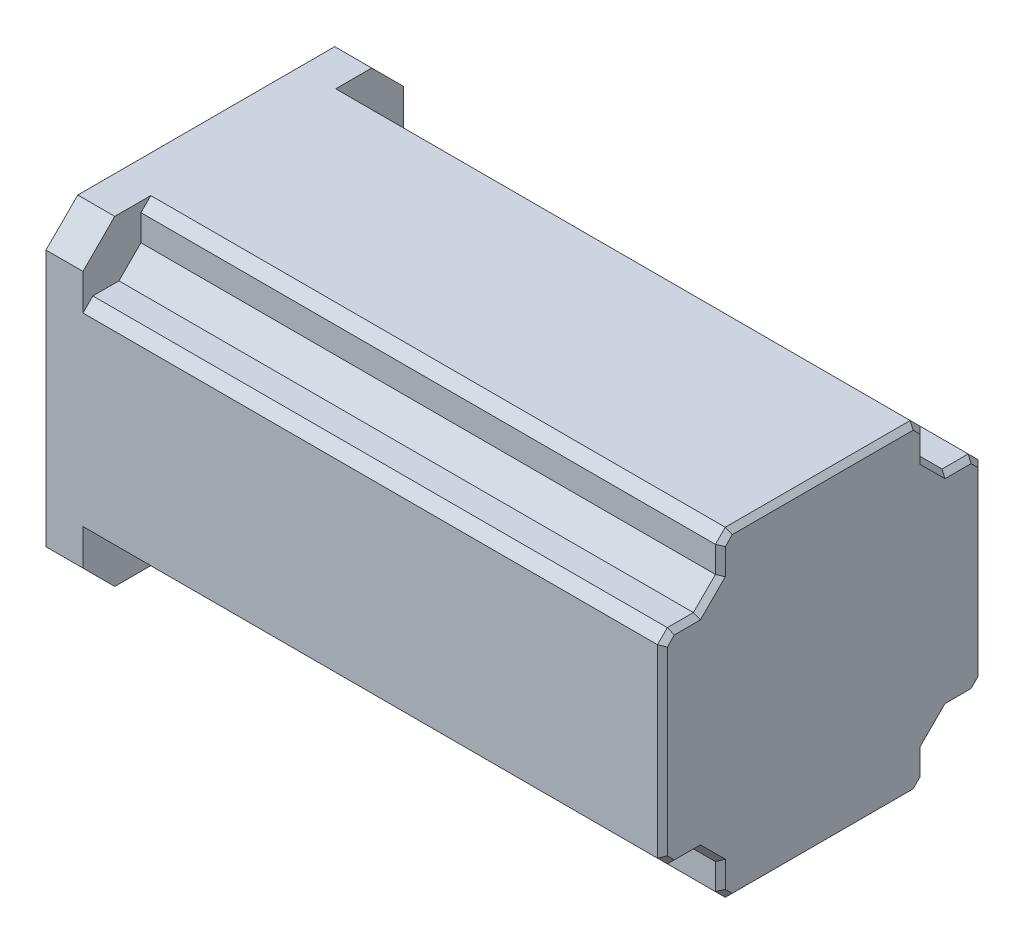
ISO-10303-21;
HEADER;
FILE_DESCRIPTION(('STEP AP214'),'2;1');
FILE_NAME('part.step','',(''),(''),'','','');
FILE_SCHEMA(('AUTOMOTIVE_DESIGN { 1 0 10303 214 1 1 1 1 }'));
ENDSEC;
DATA;
#1=APPLICATION_CONTEXT('core data for automotive mechanical design processes');
#2=APPLICATION_PROTOCOL_DEFINITION('international standard','automotive_design',2000,#1);
#3=PRODUCT_CONTEXT('',#1,'mechanical');
#4=PRODUCT('Part','Part','',(#3));
#5=PRODUCT_RELATED_PRODUCT_CATEGORY('part','',(#4));
#6=PRODUCT_DEFINITION_FORMATION('','',#4);
#7=PRODUCT_DEFINITION_CONTEXT('part definition',#1,'design');
#8=PRODUCT_DEFINITION('design','',#6,#7);
#9=PRODUCT_DEFINITION_SHAPE('','',#8);
#10=(LENGTH_UNIT() NAMED_UNIT(*) SI_UNIT(.MILLI.,.METRE.));
#11=(NAMED_UNIT(*) PLANE_ANGLE_UNIT() SI_UNIT($,.RADIAN.));
#12=(NAMED_UNIT(*) SI_UNIT($,.STERADIAN.) SOLID_ANGLE_UNIT());
#13=UNCERTAINTY_MEASURE_WITH_UNIT(LENGTH_MEASURE(1.E-05),#10,'distance_accuracy_value','');
#14=(GEOMETRIC_REPRESENTATION_CONTEXT(3) GLOBAL_UNCERTAINTY_ASSIGNED_CONTEXT((#13)) GLOBAL_UNIT_ASSIGNED_CONTEXT((#10,
#11,#12)) REPRESENTATION_CONTEXT('',''));
#15=CARTESIAN_POINT('',(0.,0.,0.));
#16=DIRECTION('',(0.,0.,1.));
#17=DIRECTION('',(1.,0.,0.));
#18=AXIS2_PLACEMENT_3D('',#15,#16,#17);
#19=CARTESIAN_POINT('',(566.92388155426,207.482021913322,2245.42388155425));
#20=DIRECTION('',(0.,-0.707106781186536,0.707106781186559));
#21=DIRECTION('',(0.,-0.707106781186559,-0.707106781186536));
#22=AXIS2_PLACEMENT_3D('',#19,#20,#21);
#23=PLANE('',#22);
#24=DIRECTION('',(-1.,0.,0.));
#25=VECTOR('',#24,1.);
#26=CARTESIAN_POINT('',(566.92388155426,198.558140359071,2236.5));
#27=LINE('',#26,#25);
#28=CARTESIAN_POINT('',(443.000000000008,198.558140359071,2236.5));
#29=VERTEX_POINT('',#28);
#30=CARTESIAN_POINT('',(210.000000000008,198.558140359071,2236.5));
#31=VERTEX_POINT('',#30);
#32=EDGE_CURVE('E358',#29,#31,#27,.T.);
#33=ORIENTED_EDGE('',*,*,#32,.F.);
#34=DIRECTION('',(0.,0.707106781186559,0.707106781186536));
#35=VECTOR('',#34,1.);
#36=CARTESIAN_POINT('',(443.000000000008,207.482021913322,2245.42388155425));
#37=LINE('',#36,#35);
#38=CARTESIAN_POINT('',(443.000000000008,207.482021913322,2245.42388155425));
#39=VERTEX_POINT('',#38);
#40=EDGE_CURVE('E10',#29,#39,#37,.T.);
#41=ORIENTED_EDGE('',*,*,#40,.T.);
#42=DIRECTION('',(-1.,0.,0.));
#43=VECTOR('',#42,1.);
#44=CARTESIAN_POINT('',(566.92388155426,207.482021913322,2245.42388155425));
#45=LINE('',#44,#43);
#46=CARTESIAN_POINT('',(210.000000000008,207.482021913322,2245.42388155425));
#47=VERTEX_POINT('',#46);
#48=EDGE_CURVE('E26',#39,#47,#45,.T.);
#49=ORIENTED_EDGE('',*,*,#48,.T.);
#50=DIRECTION('',(0.,-0.707106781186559,-0.707106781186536));
#51=VECTOR('',#50,1.);
#52=CARTESIAN_POINT('',(210.000000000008,207.482021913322,2245.42388155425));
#53=LINE('',#52,#51);
#54=EDGE_CURVE('E572',#47,#31,#53,.T.);
#55=ORIENTED_EDGE('',*,*,#54,.T.);
#56=EDGE_LOOP('',(#33,#41,#49,#55));
#57=FACE_BOUND('',#56,.T.);
#58=ADVANCED_FACE('F16',(#57),#23,.T.);
#59=CARTESIAN_POINT('',(566.92388155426,187.982021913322,2236.5));
#60=DIRECTION('',(0.,0.,1.));
#61=DIRECTION('',(0.,-1.,0.));
#62=AXIS2_PLACEMENT_3D('',#59,#60,#61);
#63=PLANE('',#62);
#64=DIRECTION('',(-1.,0.,0.));
#65=VECTOR('',#64,1.);
#66=CARTESIAN_POINT('',(566.92388155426,187.982021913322,2236.5));
#67=LINE('',#66,#65);
#68=CARTESIAN_POINT('',(443.000000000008,187.982021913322,2236.5));
#69=VERTEX_POINT('',#68);
#70=CARTESIAN_POINT('',(210.000000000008,187.982021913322,2236.5));
#71=VERTEX_POINT('',#70);
#72=EDGE_CURVE('E537',#69,#71,#67,.T.);
#73=ORIENTED_EDGE('',*,*,#72,.F.);
#74=DIRECTION('',(0.,1.,0.));
#75=VECTOR('',#74,1.);
#76=CARTESIAN_POINT('',(443.000000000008,198.558140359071,2236.5));
#77=LINE('',#76,#75);
#78=EDGE_CURVE('E361',#69,#29,#77,.T.);
#79=ORIENTED_EDGE('',*,*,#78,.T.);
#80=ORIENTED_EDGE('',*,*,#32,.T.);
#81=DIRECTION('',(0.,1.,0.));
#82=VECTOR('',#81,1.);
#83=CARTESIAN_POINT('',(210.000000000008,187.982021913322,2236.5));
#84=LINE('',#83,#82);
#85=EDGE_CURVE('E366',#71,#31,#84,.T.);
#86=ORIENTED_EDGE('',*,*,#85,.F.);
#87=EDGE_LOOP('',(#73,#79,#80,#86));
#88=FACE_BOUND('',#87,.T.);
#89=ADVANCED_FACE('F778',(#88),#63,.T.);
#90=CARTESIAN_POINT('',(566.92388155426,207.482021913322,2245.42388155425));
#91=DIRECTION('',(0.,-1.,0.));
#92=DIRECTION('',(0.,0.,-1.));
#93=AXIS2_PLACEMENT_3D('',#90,#91,#92);
#94=PLANE('',#93);
#95=ORIENTED_EDGE('',*,*,#48,.F.);
#96=DIRECTION('',(0.,0.,1.));
#97=VECTOR('',#96,1.);
#98=CARTESIAN_POINT('',(443.000000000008,207.482021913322,2256.));
#99=LINE('',#98,#97);
#100=CARTESIAN_POINT('',(443.000000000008,207.482021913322,2256.));
#101=VERTEX_POINT('',#100);
#102=EDGE_CURVE('E362',#39,#101,#99,.T.);
#103=ORIENTED_EDGE('',*,*,#102,.T.);
#104=DIRECTION('',(-1.,0.,0.));
#105=VECTOR('',#104,1.);
#106=CARTESIAN_POINT('',(566.92388155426,207.482021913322,2256.));
#107=LINE('',#106,#105);
#108=CARTESIAN_POINT('',(210.000000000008,207.482021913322,2256.));
#109=VERTEX_POINT('',#108);
#110=EDGE_CURVE('E365',#101,#109,#107,.T.);
#111=ORIENTED_EDGE('',*,*,#110,.T.);
#112=DIRECTION('',(0.,0.,1.));
#113=VECTOR('',#112,1.);
#114=CARTESIAN_POINT('',(210.000000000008,207.482021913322,2245.42388155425));
#115=LINE('',#114,#113);
#116=EDGE_CURVE('E452',#47,#109,#115,.T.);
#117=ORIENTED_EDGE('',*,*,#116,.F.);
#118=EDGE_LOOP('',(#95,#103,#111,#117));
#119=FACE_BOUND('',#118,.T.);
#120=ADVANCED_FACE('F773',(#119),#94,.T.);
#121=CARTESIAN_POINT('',(443.000000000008,207.482021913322,2245.42388155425));
#122=DIRECTION('',(0.707106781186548,-0.499999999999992,0.500000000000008));
#123=DIRECTION('',(0.577350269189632,0.,-0.816496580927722));
#124=AXIS2_PLACEMENT_3D('',#121,#122,#123);
#125=PLANE('',#124);
#126=DIRECTION('',(0.678598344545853,0.281084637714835,-0.678598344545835));
#127=VECTOR('',#126,1.);
#128=CARTESIAN_POINT('',(442.061681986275,198.169476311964,2237.43831801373));
#129=LINE('',#128,#127);
#130=CARTESIAN_POINT('',(445.000000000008,199.386567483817,2234.5));
#131=VERTEX_POINT('',#130);
#132=EDGE_CURVE('E35',#29,#131,#129,.T.);
#133=ORIENTED_EDGE('',*,*,#132,.T.);
#134=DIRECTION('',(0.,-0.707106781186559,-0.707106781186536));
#135=VECTOR('',#134,1.);
#136=CARTESIAN_POINT('',(445.000000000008,204.434294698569,2239.54772721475));
#137=LINE('',#136,#135);
#138=CARTESIAN_POINT('',(445.000000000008,209.482021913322,2244.5954544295));
#139=VERTEX_POINT('',#138);
#140=EDGE_CURVE('E601',#139,#131,#137,.T.);
#141=ORIENTED_EDGE('',*,*,#140,.F.);
#142=DIRECTION('',(0.678598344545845,0.678598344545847,-0.281084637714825));
#143=VECTOR('',#142,1.);
#144=CARTESIAN_POINT('',(443.000000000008,207.482021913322,2245.42388155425));
#145=LINE('',#144,#143);
#146=EDGE_CURVE('E530',#39,#139,#145,.T.);
#147=ORIENTED_EDGE('',*,*,#146,.F.);
#148=ORIENTED_EDGE('',*,*,#40,.F.);
#149=EDGE_LOOP('',(#133,#141,#147,#148));
#150=FACE_BOUND('',#149,.T.);
#151=ADVANCED_FACE('F754',(#150),#125,.T.);
#152=CARTESIAN_POINT('',(445.000000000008,199.146235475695,2244.83578643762));
#153=DIRECTION('',(0.707106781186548,-0.500000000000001,0.499999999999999));
#154=DIRECTION('',(0.577350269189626,0.816496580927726,0.));
#155=AXIS2_PLACEMENT_3D('',#152,#153,#154);
#156=PLANE('',#155);
#157=DIRECTION('',(0.678598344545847,0.678598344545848,-0.281084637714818));
#158=VECTOR('',#157,1.);
#159=CARTESIAN_POINT('',(442.211899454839,206.693921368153,2256.32644193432));
#160=LINE('',#159,#158);
#161=CARTESIAN_POINT('',(445.000000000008,209.482021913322,2255.17157287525));
#162=VERTEX_POINT('',#161);
#163=EDGE_CURVE('E534',#101,#162,#160,.T.);
#164=ORIENTED_EDGE('',*,*,#163,.T.);
#165=DIRECTION('',(0.,-0.707106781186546,-0.707106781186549));
#166=VECTOR('',#165,1.);
#167=CARTESIAN_POINT('',(445.000000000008,208.896235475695,2254.58578643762));
#168=LINE('',#167,#166);
#169=CARTESIAN_POINT('',(445.000000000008,212.310449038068,2258.));
#170=VERTEX_POINT('',#169);
#171=EDGE_CURVE('E676',#170,#162,#168,.T.);
#172=ORIENTED_EDGE('',*,*,#171,.F.);
#173=DIRECTION('',(0.678598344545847,0.281084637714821,-0.678598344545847));
#174=VECTOR('',#173,1.);
#175=CARTESIAN_POINT('',(448.551074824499,213.781352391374,2254.44892517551));
#176=LINE('',#175,#174);
#177=CARTESIAN_POINT('',(443.000000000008,211.482021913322,2260.));
#178=VERTEX_POINT('',#177);
#179=EDGE_CURVE('E418',#178,#170,#176,.T.);
#180=ORIENTED_EDGE('',*,*,#179,.F.);
#181=DIRECTION('',(0.,0.707106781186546,0.707106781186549));
#182=VECTOR('',#181,1.);
#183=CARTESIAN_POINT('',(443.000000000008,211.482021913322,2260.));
#184=LINE('',#183,#182);
#185=EDGE_CURVE('E626',#101,#178,#184,.T.);
#186=ORIENTED_EDGE('',*,*,#185,.F.);
#187=EDGE_LOOP('',(#164,#172,#180,#186));
#188=FACE_BOUND('',#187,.T.);
#189=ADVANCED_FACE('F766',(#188),#156,.T.);
#190=CARTESIAN_POINT('',(445.000000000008,228.529749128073,2304.54772721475));
#191=DIRECTION('',(0.707106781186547,0.499999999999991,0.500000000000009));
#192=DIRECTION('',(0.577350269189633,0.,-0.816496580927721));
#193=AXIS2_PLACEMENT_3D('',#190,#191,#192);
#194=PLANE('',#193);
#195=DIRECTION('',(-0.678598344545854,0.281084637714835,0.678598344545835));
#196=VECTOR('',#195,1.);
#197=CARTESIAN_POINT('',(426.104475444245,306.404258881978,2253.39552455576));
#198=LINE('',#197,#196);
#199=CARTESIAN_POINT('',(445.000000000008,298.577476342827,2234.5));
#200=VERTEX_POINT('',#199);
#201=CARTESIAN_POINT('',(443.000000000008,299.405903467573,2236.5));
#202=VERTEX_POINT('',#201);
#203=EDGE_CURVE('E531',#200,#202,#198,.T.);
#204=ORIENTED_EDGE('',*,*,#203,.T.);
#205=DIRECTION('',(0.,0.70710678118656,-0.707106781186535));
#206=VECTOR('',#205,1.);
#207=CARTESIAN_POINT('',(443.000000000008,290.482021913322,2245.42388155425));
#208=LINE('',#207,#206);
#209=CARTESIAN_POINT('',(443.000000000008,290.482021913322,2245.42388155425));
#210=VERTEX_POINT('',#209);
#211=EDGE_CURVE('E455',#210,#202,#208,.T.);
#212=ORIENTED_EDGE('',*,*,#211,.F.);
#213=DIRECTION('',(-0.678598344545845,0.678598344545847,0.281084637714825));
#214=VECTOR('',#213,1.);
#215=CARTESIAN_POINT('',(443.000000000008,290.482021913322,2245.42388155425));
#216=LINE('',#215,#214);
#217=CARTESIAN_POINT('',(445.000000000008,288.482021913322,2244.5954544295));
#218=VERTEX_POINT('',#217);
#219=EDGE_CURVE('E527',#218,#210,#216,.T.);
#220=ORIENTED_EDGE('',*,*,#219,.F.);
#221=DIRECTION('',(0.,-0.70710678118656,0.707106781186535));
#222=VECTOR('',#221,1.);
#223=CARTESIAN_POINT('',(445.000000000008,228.529749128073,2304.54772721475));
#224=LINE('',#223,#222);
#225=EDGE_CURVE('E421',#200,#218,#224,.T.);
#226=ORIENTED_EDGE('',*,*,#225,.F.);
#227=EDGE_LOOP('',(#204,#212,#220,#226));
#228=FACE_BOUND('',#227,.T.);
#229=ADVANCED_FACE('F871',(#228),#194,.T.);
#230=CARTESIAN_POINT('',(445.000000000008,209.482021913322,2260.));
#231=DIRECTION('',(0.707106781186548,-0.707106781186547,0.));
#232=DIRECTION('',(0.707106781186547,0.707106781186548,0.));
#233=AXIS2_PLACEMENT_3D('',#230,#231,#232);
#234=PLANE('',#233);
#235=ORIENTED_EDGE('',*,*,#146,.T.);
#236=DIRECTION('',(0.,0.,-1.));
#237=VECTOR('',#236,1.);
#238=CARTESIAN_POINT('',(445.000000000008,209.482021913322,2245.42388155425));
#239=LINE('',#238,#237);
#240=EDGE_CURVE('E673',#162,#139,#239,.T.);
#241=ORIENTED_EDGE('',*,*,#240,.F.);
#242=ORIENTED_EDGE('',*,*,#163,.F.);
#243=ORIENTED_EDGE('',*,*,#102,.F.);
#244=EDGE_LOOP('',(#235,#241,#242,#243));
#245=FACE_BOUND('',#244,.T.);
#246=ADVANCED_FACE('F762',(#245),#234,.T.);
#247=CARTESIAN_POINT('',(443.000000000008,290.482021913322,2245.42388155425));
#248=DIRECTION('',(0.707106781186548,0.707106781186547,0.));
#249=DIRECTION('',(-0.707106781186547,0.707106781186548,0.));
#250=AXIS2_PLACEMENT_3D('',#247,#248,#249);
#251=PLANE('',#250);
#252=ORIENTED_EDGE('',*,*,#219,.T.);
#253=DIRECTION('',(0.,0.,-1.));
#254=VECTOR('',#253,1.);
#255=CARTESIAN_POINT('',(443.000000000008,290.482021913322,2245.42388155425));
#256=LINE('',#255,#254);
#257=CARTESIAN_POINT('',(443.000000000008,290.482021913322,2256.));
#258=VERTEX_POINT('',#257);
#259=EDGE_CURVE('E699',#258,#210,#256,.T.);
#260=ORIENTED_EDGE('',*,*,#259,.F.);
#261=DIRECTION('',(-0.678598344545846,0.678598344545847,0.281084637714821));
#262=VECTOR('',#261,1.);
#263=CARTESIAN_POINT('',(445.017326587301,288.464695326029,2255.16439596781));
#264=LINE('',#263,#262);
#265=CARTESIAN_POINT('',(445.000000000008,288.482021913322,2255.17157287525));
#266=VERTEX_POINT('',#265);
#267=EDGE_CURVE('E406',#266,#258,#264,.T.);
#268=ORIENTED_EDGE('',*,*,#267,.F.);
#269=DIRECTION('',(0.,0.,1.));
#270=VECTOR('',#269,1.);
#271=CARTESIAN_POINT('',(445.000000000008,288.482021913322,2256.));
#272=LINE('',#271,#270);
#273=EDGE_CURVE('E419',#218,#266,#272,.T.);
#274=ORIENTED_EDGE('',*,*,#273,.F.);
#275=EDGE_LOOP('',(#252,#260,#268,#274));
#276=FACE_BOUND('',#275,.T.);
#277=ADVANCED_FACE('F878',(#276),#251,.T.);
#278=CARTESIAN_POINT('',(443.000000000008,309.982021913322,2236.5));
#279=DIRECTION('',(0.707106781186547,0.,0.707106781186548));
#280=DIRECTION('',(0.707106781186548,0.,-0.707106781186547));
#281=AXIS2_PLACEMENT_3D('',#278,#279,#280);
#282=PLANE('',#281);
#283=DIRECTION('',(-0.678598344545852,0.28108463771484,0.678598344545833));
#284=VECTOR('',#283,1.);
#285=CARTESIAN_POINT('',(424.678010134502,317.571238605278,2254.8219898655));
#286=LINE('',#285,#284);
#287=CARTESIAN_POINT('',(445.000000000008,309.153594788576,2234.5));
#288=VERTEX_POINT('',#287);
#289=CARTESIAN_POINT('',(443.000000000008,309.982021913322,2236.5));
#290=VERTEX_POINT('',#289);
#291=EDGE_CURVE('E409',#288,#290,#286,.T.);
#292=ORIENTED_EDGE('',*,*,#291,.T.);
#293=DIRECTION('',(0.,1.,0.));
#294=VECTOR('',#293,1.);
#295=CARTESIAN_POINT('',(443.000000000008,309.982021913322,2236.5));
#296=LINE('',#295,#294);
#297=EDGE_CURVE('E370',#202,#290,#296,.T.);
#298=ORIENTED_EDGE('',*,*,#297,.F.);
#299=ORIENTED_EDGE('',*,*,#203,.F.);
#300=DIRECTION('',(0.,-1.,0.));
#301=VECTOR('',#300,1.);
#302=CARTESIAN_POINT('',(445.000000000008,299.405903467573,2234.5));
#303=LINE('',#302,#301);
#304=EDGE_CURVE('E427',#288,#200,#303,.T.);
#305=ORIENTED_EDGE('',*,*,#304,.F.);
#306=EDGE_LOOP('',(#292,#298,#299,#305));
#307=FACE_BOUND('',#306,.T.);
#308=ADVANCED_FACE('F868',(#307),#282,.T.);
#309=CARTESIAN_POINT('',(443.000000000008,290.482021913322,2256.));
#310=DIRECTION('',(0.707106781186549,0.5,0.499999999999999));
#311=DIRECTION('',(-0.577350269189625,0.816496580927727,0.));
#312=AXIS2_PLACEMENT_3D('',#309,#310,#311);
#313=PLANE('',#312);
#314=ORIENTED_EDGE('',*,*,#267,.T.);
#315=DIRECTION('',(0.,0.707106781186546,-0.707106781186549));
#316=VECTOR('',#315,1.);
#317=CARTESIAN_POINT('',(443.000000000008,290.482021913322,2256.));
#318=LINE('',#317,#316);
#319=CARTESIAN_POINT('',(443.000000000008,286.482021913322,2260.));
#320=VERTEX_POINT('',#319);
#321=EDGE_CURVE('E456',#320,#258,#318,.T.);
#322=ORIENTED_EDGE('',*,*,#321,.F.);
#323=DIRECTION('',(-0.678598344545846,0.281084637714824,0.678598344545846));
#324=VECTOR('',#323,1.);
#325=CARTESIAN_POINT('',(444.079008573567,286.035081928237,2258.92099142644));
#326=LINE('',#325,#324);
#327=CARTESIAN_POINT('',(445.000000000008,285.653594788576,2258.));
#328=VERTEX_POINT('',#327);
#329=EDGE_CURVE('E414',#328,#320,#326,.T.);
#330=ORIENTED_EDGE('',*,*,#329,.F.);
#331=DIRECTION('',(0.,-0.707106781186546,0.707106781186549));
#332=VECTOR('',#331,1.);
#333=CARTESIAN_POINT('',(445.000000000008,285.067808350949,2258.58578643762));
#334=LINE('',#333,#332);
#335=EDGE_CURVE('E592',#266,#328,#334,.T.);
#336=ORIENTED_EDGE('',*,*,#335,.F.);
#337=EDGE_LOOP('',(#314,#322,#330,#336));
#338=FACE_BOUND('',#337,.T.);
#339=ADVANCED_FACE('F882',(#338),#313,.T.);
#340=CARTESIAN_POINT('',(445.000000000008,183.982021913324,2234.5));
#341=DIRECTION('',(0.707106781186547,0.,0.707106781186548));
#342=DIRECTION('',(0.707106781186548,0.,-0.707106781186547));
#343=AXIS2_PLACEMENT_3D('',#340,#341,#342);
#344=PLANE('',#343);
#345=DIRECTION('',(0.678598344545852,0.281084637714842,-0.678598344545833));
#346=VECTOR('',#345,1.);
#347=CARTESIAN_POINT('',(444.079008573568,188.428961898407,2235.42099142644));
#348=LINE('',#347,#346);
#349=CARTESIAN_POINT('',(445.000000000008,188.810449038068,2234.5));
#350=VERTEX_POINT('',#349);
#351=EDGE_CURVE('E410',#69,#350,#348,.T.);
#352=ORIENTED_EDGE('',*,*,#351,.T.);
#353=DIRECTION('',(0.,-1.,0.));
#354=VECTOR('',#353,1.);
#355=CARTESIAN_POINT('',(445.000000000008,187.982021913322,2234.5));
#356=LINE('',#355,#354);
#357=EDGE_CURVE('E458',#131,#350,#356,.T.);
#358=ORIENTED_EDGE('',*,*,#357,.F.);
#359=ORIENTED_EDGE('',*,*,#132,.F.);
#360=ORIENTED_EDGE('',*,*,#78,.F.);
#361=EDGE_LOOP('',(#352,#358,#359,#360));
#362=FACE_BOUND('',#361,.T.);
#363=ADVANCED_FACE('F756',(#362),#344,.T.);
#364=CARTESIAN_POINT('',(443.000000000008,187.982021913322,2236.5));
#365=DIRECTION('',(0.707106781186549,-0.499999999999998,0.500000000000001));
#366=DIRECTION('',(0.577350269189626,0.,-0.816496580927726));
#367=AXIS2_PLACEMENT_3D('',#364,#365,#366);
#368=PLANE('',#367);
#369=DIRECTION('',(0.678598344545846,0.678598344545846,-0.281084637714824));
#370=VECTOR('',#369,1.);
#371=CARTESIAN_POINT('',(444.079008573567,185.061030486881,2232.05306001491));
#372=LINE('',#371,#370);
#373=CARTESIAN_POINT('',(443.000000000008,183.982021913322,2232.5));
#374=VERTEX_POINT('',#373);
#375=CARTESIAN_POINT('',(445.000000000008,185.982021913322,2231.67157287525));
#376=VERTEX_POINT('',#375);
#377=EDGE_CURVE('E413',#374,#376,#372,.T.);
#378=ORIENTED_EDGE('',*,*,#377,.T.);
#379=DIRECTION('',(0.,-0.707106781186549,-0.707106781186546));
#380=VECTOR('',#379,1.);
#381=CARTESIAN_POINT('',(445.000000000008,199.146235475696,2244.83578643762));
#382=LINE('',#381,#380);
#383=EDGE_CURVE('E379',#350,#376,#382,.T.);
#384=ORIENTED_EDGE('',*,*,#383,.F.);
#385=ORIENTED_EDGE('',*,*,#351,.F.);
#386=DIRECTION('',(0.,0.707106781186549,0.707106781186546));
#387=VECTOR('',#386,1.);
#388=CARTESIAN_POINT('',(443.000000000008,187.982021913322,2236.5));
#389=LINE('',#388,#387);
#390=EDGE_CURVE('E578',#374,#69,#389,.T.);
#391=ORIENTED_EDGE('',*,*,#390,.F.);
#392=EDGE_LOOP('',(#378,#384,#385,#391));
#393=FACE_BOUND('',#392,.T.);
#394=ADVANCED_FACE('F806',(#393),#368,.T.);
#395=CARTESIAN_POINT('',(443.000000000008,187.982021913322,2153.5));
#396=DIRECTION('',(0.707106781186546,0.,-0.707106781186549));
#397=DIRECTION('',(-0.707106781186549,0.,-0.707106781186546));
#398=AXIS2_PLACEMENT_3D('',#395,#396,#397);
#399=PLANE('',#398);
#400=DIRECTION('',(0.678598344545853,0.281084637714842,0.678598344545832));
#401=VECTOR('',#400,1.);
#402=CARTESIAN_POINT('',(461.172254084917,206.085334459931,2171.67225408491));
#403=LINE('',#402,#401);
#404=CARTESIAN_POINT('',(443.000000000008,198.558140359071,2153.5));
#405=VERTEX_POINT('',#404);
#406=CARTESIAN_POINT('',(445.000000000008,199.386567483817,2155.5));
#407=VERTEX_POINT('',#406);
#408=EDGE_CURVE('E552',#405,#407,#403,.T.);
#409=ORIENTED_EDGE('',*,*,#408,.T.);
#410=DIRECTION('',(0.,1.,0.));
#411=VECTOR('',#410,1.);
#412=CARTESIAN_POINT('',(445.000000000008,198.558140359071,2155.5));
#413=LINE('',#412,#411);
#414=CARTESIAN_POINT('',(445.000000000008,188.810449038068,2155.5));
#415=VERTEX_POINT('',#414);
#416=EDGE_CURVE('E558',#415,#407,#413,.T.);
#417=ORIENTED_EDGE('',*,*,#416,.F.);
#418=DIRECTION('',(0.678598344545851,0.281084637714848,0.678598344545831));
#419=VECTOR('',#418,1.);
#420=CARTESIAN_POINT('',(459.745788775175,194.918354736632,2170.24578877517));
#421=LINE('',#420,#419);
#422=CARTESIAN_POINT('',(443.000000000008,187.982021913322,2153.5));
#423=VERTEX_POINT('',#422);
#424=EDGE_CURVE('E482',#423,#415,#421,.T.);
#425=ORIENTED_EDGE('',*,*,#424,.F.);
#426=DIRECTION('',(0.,-1.,0.));
#427=VECTOR('',#426,1.);
#428=CARTESIAN_POINT('',(443.000000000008,187.982021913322,2153.5));
#429=LINE('',#428,#427);
#430=EDGE_CURVE('E422',#405,#423,#429,.T.);
#431=ORIENTED_EDGE('',*,*,#430,.F.);
#432=EDGE_LOOP('',(#409,#417,#425,#431));
#433=FACE_BOUND('',#432,.T.);
#434=ADVANCED_FACE('F818',(#433),#399,.T.);
#435=CARTESIAN_POINT('',(445.000000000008,139.434294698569,2215.45227278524));
#436=DIRECTION('',(0.70710678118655,-0.499999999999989,-0.500000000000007));
#437=DIRECTION('',(-0.57735026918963,0.,-0.816496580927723));
#438=AXIS2_PLACEMENT_3D('',#435,#436,#437);
#439=PLANE('',#438);
#440=DIRECTION('',(0.678598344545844,0.678598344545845,0.281084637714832));
#441=VECTOR('',#440,1.);
#442=CARTESIAN_POINT('',(443.000000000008,207.482021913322,2144.57611844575));
#443=LINE('',#442,#441);
#444=CARTESIAN_POINT('',(443.000000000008,207.482021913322,2144.57611844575));
#445=VERTEX_POINT('',#444);
#446=CARTESIAN_POINT('',(445.000000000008,209.482021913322,2145.40454557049));
#447=VERTEX_POINT('',#446);
#448=EDGE_CURVE('E481',#445,#447,#443,.T.);
#449=ORIENTED_EDGE('',*,*,#448,.T.);
#450=DIRECTION('',(0.,0.70710678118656,-0.707106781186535));
#451=VECTOR('',#450,1.);
#452=CARTESIAN_POINT('',(445.000000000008,139.434294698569,2215.45227278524));
#453=LINE('',#452,#451);
#454=EDGE_CURVE('E510',#407,#447,#453,.T.);
#455=ORIENTED_EDGE('',*,*,#454,.F.);
#456=ORIENTED_EDGE('',*,*,#408,.F.);
#457=DIRECTION('',(0.,-0.70710678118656,0.707106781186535));
#458=VECTOR('',#457,1.);
#459=CARTESIAN_POINT('',(443.000000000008,207.482021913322,2144.57611844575));
#460=LINE('',#459,#458);
#461=EDGE_CURVE('E653',#445,#405,#460,.T.);
#462=ORIENTED_EDGE('',*,*,#461,.F.);
#463=EDGE_LOOP('',(#449,#455,#456,#462));
#464=FACE_BOUND('',#463,.T.);
#465=ADVANCED_FACE('F822',(#464),#439,.T.);
#466=CARTESIAN_POINT('',(443.000000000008,207.482021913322,2144.57611844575));
#467=DIRECTION('',(0.707106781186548,-0.707106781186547,0.));
#468=DIRECTION('',(0.707106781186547,0.707106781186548,0.));
#469=AXIS2_PLACEMENT_3D('',#466,#467,#468);
#470=PLANE('',#469);
#471=DIRECTION('',(0.678598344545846,0.678598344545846,0.281084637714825));
#472=VECTOR('',#471,1.);
#473=CARTESIAN_POINT('',(445.017326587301,209.499348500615,2134.83560403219));
#474=LINE('',#473,#472);
#475=CARTESIAN_POINT('',(443.000000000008,207.482021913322,2134.));
#476=VERTEX_POINT('',#475);
#477=CARTESIAN_POINT('',(445.000000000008,209.482021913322,2134.82842712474));
#478=VERTEX_POINT('',#477);
#479=EDGE_CURVE('E478',#476,#478,#474,.T.);
#480=ORIENTED_EDGE('',*,*,#479,.T.);
#481=DIRECTION('',(0.,0.,-1.));
#482=VECTOR('',#481,1.);
#483=CARTESIAN_POINT('',(445.000000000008,209.482021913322,2134.));
#484=LINE('',#483,#482);
#485=EDGE_CURVE('E374',#447,#478,#484,.T.);
#486=ORIENTED_EDGE('',*,*,#485,.F.);
#487=ORIENTED_EDGE('',*,*,#448,.F.);
#488=DIRECTION('',(0.,0.,1.));
#489=VECTOR('',#488,1.);
#490=CARTESIAN_POINT('',(443.000000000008,207.482021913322,2144.57611844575));
#491=LINE('',#490,#489);
#492=EDGE_CURVE('E619',#476,#445,#491,.T.);
#493=ORIENTED_EDGE('',*,*,#492,.F.);
#494=EDGE_LOOP('',(#480,#486,#487,#493));
#495=FACE_BOUND('',#494,.T.);
#496=ADVANCED_FACE('F831',(#495),#470,.T.);
#497=CARTESIAN_POINT('',(445.000000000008,134.146235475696,2210.16421356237));
#498=DIRECTION('',(0.70710678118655,-0.499999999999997,-0.5));
#499=DIRECTION('',(-0.577350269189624,0.,-0.816496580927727));
#500=AXIS2_PLACEMENT_3D('',#497,#498,#499);
#501=PLANE('',#500);
#502=ORIENTED_EDGE('',*,*,#424,.T.);
#503=DIRECTION('',(0.,0.70710678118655,-0.707106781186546));
#504=VECTOR('',#503,1.);
#505=CARTESIAN_POINT('',(445.000000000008,134.146235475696,2210.16421356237));
#506=LINE('',#505,#504);
#507=CARTESIAN_POINT('',(445.000000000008,185.982021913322,2158.32842712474));
#508=VERTEX_POINT('',#507);
#509=EDGE_CURVE('E380',#508,#415,#506,.T.);
#510=ORIENTED_EDGE('',*,*,#509,.F.);
#511=DIRECTION('',(0.678598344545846,0.678598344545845,0.281084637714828));
#512=VECTOR('',#511,1.);
#513=CARTESIAN_POINT('',(464.393198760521,205.375220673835,2166.36135306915));
#514=LINE('',#513,#512);
#515=CARTESIAN_POINT('',(443.000000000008,183.982021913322,2157.5));
#516=VERTEX_POINT('',#515);
#517=EDGE_CURVE('E448',#516,#508,#514,.T.);
#518=ORIENTED_EDGE('',*,*,#517,.F.);
#519=DIRECTION('',(0.,-0.70710678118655,0.707106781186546));
#520=VECTOR('',#519,1.);
#521=CARTESIAN_POINT('',(443.000000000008,187.982021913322,2153.5));
#522=LINE('',#521,#520);
#523=EDGE_CURVE('E630',#423,#516,#522,.T.);
#524=ORIENTED_EDGE('',*,*,#523,.F.);
#525=EDGE_LOOP('',(#502,#510,#518,#524));
#526=FACE_BOUND('',#525,.T.);
#527=ADVANCED_FACE('F814',(#526),#501,.T.);
#528=CARTESIAN_POINT('',(185.000000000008,248.982021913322,2195.));
#529=DIRECTION('',(-1.,0.,0.));
#530=DIRECTION('',(0.,0.,1.));
#531=AXIS2_PLACEMENT_3D('',#528,#529,#530);
#532=PLANE('',#531);
#533=CARTESIAN_POINT('',(185.000000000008,248.982021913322,2195.));
#534=DIRECTION('',(-1.,0.,0.));
#535=DIRECTION('',(0.,-1.,0.));
#536=AXIS2_PLACEMENT_3D('',#533,#534,#535);
#537=CIRCLE('',#536,47.5);
#538=CARTESIAN_POINT('',(185.000000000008,296.482021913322,2195.));
#539=VERTEX_POINT('',#538);
#540=CARTESIAN_POINT('',(185.000000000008,201.482021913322,2195.));
#541=VERTEX_POINT('',#540);
#542=EDGE_CURVE('E545',#539,#541,#537,.T.);
#543=ORIENTED_EDGE('',*,*,#542,.T.);
#544=CARTESIAN_POINT('',(185.000000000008,248.982021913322,2195.));
#545=DIRECTION('',(-1.,0.,0.));
#546=DIRECTION('',(0.,-1.,0.));
#547=AXIS2_PLACEMENT_3D('',#544,#545,#546);
#548=CIRCLE('',#547,47.5);
#549=EDGE_CURVE('E417',#541,#539,#548,.T.);
#550=ORIENTED_EDGE('',*,*,#549,.T.);
#551=EDGE_LOOP('',(#543,#550));
#552=FACE_BOUND('',#551,.T.);
#553=ADVANCED_FACE('F684',(#552),#532,.T.);
#554=CARTESIAN_POINT('',(445.000000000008,183.982021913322,2258.));
#555=DIRECTION('',(0.707106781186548,0.,0.707106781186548));
#556=DIRECTION('',(0.707106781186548,0.,-0.707106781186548));
#557=AXIS2_PLACEMENT_3D('',#554,#555,#556);
#558=PLANE('',#557);
#559=ORIENTED_EDGE('',*,*,#329,.T.);
#560=DIRECTION('',(0.,1.,0.));
#561=VECTOR('',#560,1.);
#562=CARTESIAN_POINT('',(443.000000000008,205.982021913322,2260.));
#563=LINE('',#562,#561);
#564=EDGE_CURVE('E515',#178,#320,#563,.T.);
#565=ORIENTED_EDGE('',*,*,#564,.F.);
#566=ORIENTED_EDGE('',*,*,#179,.T.);
#567=DIRECTION('',(0.,-1.,0.));
#568=VECTOR('',#567,1.);
#569=CARTESIAN_POINT('',(445.000000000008,183.982021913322,2258.));
#570=LINE('',#569,#568);
#571=EDGE_CURVE('E640',#328,#170,#570,.T.);
#572=ORIENTED_EDGE('',*,*,#571,.F.);
#573=EDGE_LOOP('',(#559,#565,#566,#572));
#574=FACE_BOUND('',#573,.T.);
#575=ADVANCED_FACE('F885',(#574),#558,.T.);
#576=CARTESIAN_POINT('',(566.92388155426,207.482021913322,2256.));
#577=DIRECTION('',(0.,-0.707106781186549,0.707106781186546));
#578=DIRECTION('',(0.,-0.707106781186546,-0.707106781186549));
#579=AXIS2_PLACEMENT_3D('',#576,#577,#578);
#580=PLANE('',#579);
#581=ORIENTED_EDGE('',*,*,#110,.F.);
#582=ORIENTED_EDGE('',*,*,#185,.T.);
#583=DIRECTION('',(-1.,0.,0.));
#584=VECTOR('',#583,1.);
#585=CARTESIAN_POINT('',(566.92388155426,211.482021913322,2260.));
#586=LINE('',#585,#584);
#587=CARTESIAN_POINT('',(210.000000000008,211.482021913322,2260.));
#588=VERTEX_POINT('',#587);
#589=EDGE_CURVE('E581',#178,#588,#586,.T.);
#590=ORIENTED_EDGE('',*,*,#589,.T.);
#591=DIRECTION('',(0.,0.707106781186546,0.707106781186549));
#592=VECTOR('',#591,1.);
#593=CARTESIAN_POINT('',(210.000000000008,207.482021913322,2256.));
#594=LINE('',#593,#592);
#595=EDGE_CURVE('E538',#109,#588,#594,.T.);
#596=ORIENTED_EDGE('',*,*,#595,.F.);
#597=EDGE_LOOP('',(#581,#582,#590,#596));
#598=FACE_BOUND('',#597,.T.);
#599=ADVANCED_FACE('F769',(#598),#580,.T.);
#600=CARTESIAN_POINT('',(566.92388155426,187.982021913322,2236.5));
#601=DIRECTION('',(0.,-0.707106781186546,0.707106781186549));
#602=DIRECTION('',(0.,-0.707106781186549,-0.707106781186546));
#603=AXIS2_PLACEMENT_3D('',#600,#601,#602);
#604=PLANE('',#603);
#605=DIRECTION('',(-1.,0.,0.));
#606=VECTOR('',#605,1.);
#607=CARTESIAN_POINT('',(566.92388155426,183.982021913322,2232.5));
#608=LINE('',#607,#606);
#609=CARTESIAN_POINT('',(210.000000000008,183.982021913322,2232.5));
#610=VERTEX_POINT('',#609);
#611=EDGE_CURVE('E490',#374,#610,#608,.T.);
#612=ORIENTED_EDGE('',*,*,#611,.F.);
#613=ORIENTED_EDGE('',*,*,#390,.T.);
#614=ORIENTED_EDGE('',*,*,#72,.T.);
#615=DIRECTION('',(0.,-0.707106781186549,-0.707106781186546));
#616=VECTOR('',#615,1.);
#617=CARTESIAN_POINT('',(210.000000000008,187.982021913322,2236.5));
#618=LINE('',#617,#616);
#619=EDGE_CURVE('E451',#71,#610,#618,.T.);
#620=ORIENTED_EDGE('',*,*,#619,.T.);
#621=EDGE_LOOP('',(#612,#613,#614,#620));
#622=FACE_BOUND('',#621,.T.);
#623=ADVANCED_FACE('F803',(#622),#604,.T.);
#624=CARTESIAN_POINT('',(445.000000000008,185.982021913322,2260.));
#625=DIRECTION('',(0.707106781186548,-0.707106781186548,0.));
#626=DIRECTION('',(0.707106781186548,0.707106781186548,0.));
#627=AXIS2_PLACEMENT_3D('',#624,#625,#626);
#628=PLANE('',#627);
#629=ORIENTED_EDGE('',*,*,#517,.T.);
#630=DIRECTION('',(0.,0.,-1.));
#631=VECTOR('',#630,1.);
#632=CARTESIAN_POINT('',(445.000000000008,185.982021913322,2157.5));
#633=LINE('',#632,#631);
#634=EDGE_CURVE('E376',#376,#508,#633,.T.);
#635=ORIENTED_EDGE('',*,*,#634,.F.);
#636=ORIENTED_EDGE('',*,*,#377,.F.);
#637=DIRECTION('',(0.,0.,1.));
#638=VECTOR('',#637,1.);
#639=CARTESIAN_POINT('',(443.000000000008,183.982021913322,2232.5));
#640=LINE('',#639,#638);
#641=EDGE_CURVE('E644',#516,#374,#640,.T.);
#642=ORIENTED_EDGE('',*,*,#641,.F.);
#643=EDGE_LOOP('',(#629,#635,#636,#642));
#644=FACE_BOUND('',#643,.T.);
#645=ADVANCED_FACE('F810',(#644),#628,.T.);
#646=CARTESIAN_POINT('',(210.000000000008,183.982021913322,2260.));
#647=DIRECTION('',(1.,0.,0.));
#648=DIRECTION('',(0.,0.,-1.));
#649=AXIS2_PLACEMENT_3D('',#646,#647,#648);
#650=PLANE('',#649);
#651=ORIENTED_EDGE('',*,*,#116,.T.);
#652=ORIENTED_EDGE('',*,*,#595,.T.);
#653=DIRECTION('',(0.,-1.,0.));
#654=VECTOR('',#653,1.);
#655=CARTESIAN_POINT('',(210.000000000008,248.982021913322,2260.));
#656=LINE('',#655,#654);
#657=CARTESIAN_POINT('',(210.000000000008,196.869323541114,2260.));
#658=VERTEX_POINT('',#657);
#659=EDGE_CURVE('E541',#588,#658,#656,.T.);
#660=ORIENTED_EDGE('',*,*,#659,.T.);
#661=DIRECTION('',(0.,-0.707106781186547,-0.707106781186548));
#662=VECTOR('',#661,1.);
#663=CARTESIAN_POINT('',(210.000000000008,196.869323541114,2260.));
#664=LINE('',#663,#662);
#665=CARTESIAN_POINT('',(210.000000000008,183.982021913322,2247.11269837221));
#666=VERTEX_POINT('',#665);
#667=EDGE_CURVE('E369',#658,#666,#664,.T.);
#668=ORIENTED_EDGE('',*,*,#667,.T.);
#669=DIRECTION('',(0.,0.,1.));
#670=VECTOR('',#669,1.);
#671=CARTESIAN_POINT('',(210.000000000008,183.982021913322,2238.));
#672=LINE('',#671,#670);
#673=EDGE_CURVE('E488',#610,#666,#672,.T.);
#674=ORIENTED_EDGE('',*,*,#673,.F.);
#675=ORIENTED_EDGE('',*,*,#619,.F.);
#676=ORIENTED_EDGE('',*,*,#85,.T.);
#677=ORIENTED_EDGE('',*,*,#54,.F.);
#678=EDGE_LOOP('',(#651,#652,#660,#668,#674,#675,#676,#677));
#679=FACE_BOUND('',#678,.T.);
#680=ADVANCED_FACE('F800',(#679),#650,.T.);
#681=CARTESIAN_POINT('',(566.92388155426,309.982021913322,2236.5));
#682=DIRECTION('',(0.,0.,1.));
#683=DIRECTION('',(0.,-1.,0.));
#684=AXIS2_PLACEMENT_3D('',#681,#682,#683);
#685=PLANE('',#684);
#686=DIRECTION('',(-1.,0.,0.));
#687=VECTOR('',#686,1.);
#688=CARTESIAN_POINT('',(566.92388155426,299.405903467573,2236.5));
#689=LINE('',#688,#687);
#690=CARTESIAN_POINT('',(210.000000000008,299.405903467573,2236.5));
#691=VERTEX_POINT('',#690);
#692=EDGE_CURVE('E453',#202,#691,#689,.T.);
#693=ORIENTED_EDGE('',*,*,#692,.F.);
#694=ORIENTED_EDGE('',*,*,#297,.T.);
#695=DIRECTION('',(-1.,0.,0.));
#696=VECTOR('',#695,1.);
#697=CARTESIAN_POINT('',(566.92388155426,309.982021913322,2236.5));
#698=LINE('',#697,#696);
#699=CARTESIAN_POINT('',(210.000000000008,309.982021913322,2236.5));
#700=VERTEX_POINT('',#699);
#701=EDGE_CURVE('E597',#290,#700,#698,.T.);
#702=ORIENTED_EDGE('',*,*,#701,.T.);
#703=DIRECTION('',(0.,-1.,0.));
#704=VECTOR('',#703,1.);
#705=CARTESIAN_POINT('',(210.000000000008,309.982021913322,2236.5));
#706=LINE('',#705,#704);
#707=EDGE_CURVE('E702',#700,#691,#706,.T.);
#708=ORIENTED_EDGE('',*,*,#707,.T.);
#709=EDGE_LOOP('',(#693,#694,#702,#708));
#710=FACE_BOUND('',#709,.T.);
#711=ADVANCED_FACE('F953',(#710),#685,.T.);
#712=CARTESIAN_POINT('',(566.92388155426,290.482021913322,2245.42388155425));
#713=DIRECTION('',(0.,1.,0.));
#714=DIRECTION('',(0.,0.,1.));
#715=AXIS2_PLACEMENT_3D('',#712,#713,#714);
#716=PLANE('',#715);
#717=DIRECTION('',(-1.,0.,0.));
#718=VECTOR('',#717,1.);
#719=CARTESIAN_POINT('',(566.92388155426,290.482021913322,2256.));
#720=LINE('',#719,#718);
#721=CARTESIAN_POINT('',(210.000000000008,290.482021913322,2256.));
#722=VERTEX_POINT('',#721);
#723=EDGE_CURVE('E384',#258,#722,#720,.T.);
#724=ORIENTED_EDGE('',*,*,#723,.F.);
#725=ORIENTED_EDGE('',*,*,#259,.T.);
#726=DIRECTION('',(-1.,0.,0.));
#727=VECTOR('',#726,1.);
#728=CARTESIAN_POINT('',(566.92388155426,290.482021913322,2245.42388155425));
#729=LINE('',#728,#727);
#730=CARTESIAN_POINT('',(210.000000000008,290.482021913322,2245.42388155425));
#731=VERTEX_POINT('',#730);
#732=EDGE_CURVE('E565',#210,#731,#729,.T.);
#733=ORIENTED_EDGE('',*,*,#732,.T.);
#734=DIRECTION('',(0.,0.,1.));
#735=VECTOR('',#734,1.);
#736=CARTESIAN_POINT('',(210.000000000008,290.482021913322,2245.42388155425));
#737=LINE('',#736,#735);
#738=EDGE_CURVE('E544',#731,#722,#737,.T.);
#739=ORIENTED_EDGE('',*,*,#738,.T.);
#740=EDGE_LOOP('',(#724,#725,#733,#739));
#741=FACE_BOUND('',#740,.T.);
#742=ADVANCED_FACE('F959',(#741),#716,.T.);
#743=CARTESIAN_POINT('',(566.92388155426,290.482021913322,2245.42388155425));
#744=DIRECTION('',(0.,0.707106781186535,0.70710678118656));
#745=DIRECTION('',(0.,-0.70710678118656,0.707106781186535));
#746=AXIS2_PLACEMENT_3D('',#743,#744,#745);
#747=PLANE('',#746);
#748=ORIENTED_EDGE('',*,*,#732,.F.);
#749=ORIENTED_EDGE('',*,*,#211,.T.);
#750=ORIENTED_EDGE('',*,*,#692,.T.);
#751=DIRECTION('',(0.,0.70710678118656,-0.707106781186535));
#752=VECTOR('',#751,1.);
#753=CARTESIAN_POINT('',(210.000000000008,290.482021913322,2245.42388155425));
#754=LINE('',#753,#752);
#755=EDGE_CURVE('E463',#731,#691,#754,.T.);
#756=ORIENTED_EDGE('',*,*,#755,.F.);
#757=EDGE_LOOP('',(#748,#749,#750,#756));
#758=FACE_BOUND('',#757,.T.);
#759=ADVANCED_FACE('F966',(#758),#747,.T.);
#760=CARTESIAN_POINT('',(566.92388155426,290.482021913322,2256.));
#761=DIRECTION('',(0.,0.707106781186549,0.707106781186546));
#762=DIRECTION('',(0.,-0.707106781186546,0.707106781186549));
#763=AXIS2_PLACEMENT_3D('',#760,#761,#762);
#764=PLANE('',#763);
#765=DIRECTION('',(-1.,0.,0.));
#766=VECTOR('',#765,1.);
#767=CARTESIAN_POINT('',(566.92388155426,286.482021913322,2260.));
#768=LINE('',#767,#766);
#769=CARTESIAN_POINT('',(210.000000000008,286.482021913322,2260.));
#770=VERTEX_POINT('',#769);
#771=EDGE_CURVE('E498',#320,#770,#768,.T.);
#772=ORIENTED_EDGE('',*,*,#771,.F.);
#773=ORIENTED_EDGE('',*,*,#321,.T.);
#774=ORIENTED_EDGE('',*,*,#723,.T.);
#775=DIRECTION('',(0.,-0.707106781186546,0.707106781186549));
#776=VECTOR('',#775,1.);
#777=CARTESIAN_POINT('',(210.000000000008,290.482021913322,2256.));
#778=LINE('',#777,#776);
#779=EDGE_CURVE('E381',#722,#770,#778,.T.);
#780=ORIENTED_EDGE('',*,*,#779,.T.);
#781=EDGE_LOOP('',(#772,#773,#774,#780));
#782=FACE_BOUND('',#781,.T.);
#783=ADVANCED_FACE('F973',(#782),#764,.T.);
#784=CARTESIAN_POINT('',(445.000000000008,233.817808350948,2309.83578643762));
#785=DIRECTION('',(0.707106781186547,0.499999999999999,0.500000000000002));
#786=DIRECTION('',(0.577350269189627,0.,-0.816496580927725));
#787=AXIS2_PLACEMENT_3D('',#784,#785,#786);
#788=PLANE('',#787);
#789=DIRECTION('',(-0.678598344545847,0.678598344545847,0.281084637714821));
#790=VECTOR('',#789,1.);
#791=CARTESIAN_POINT('',(450.152883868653,306.829138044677,2229.53717849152));
#792=LINE('',#791,#790);
#793=CARTESIAN_POINT('',(445.000000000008,311.982021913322,2231.67157287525));
#794=VERTEX_POINT('',#793);
#795=CARTESIAN_POINT('',(443.000000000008,313.982021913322,2232.5));
#796=VERTEX_POINT('',#795);
#797=EDGE_CURVE('E385',#794,#796,#792,.T.);
#798=ORIENTED_EDGE('',*,*,#797,.T.);
#799=DIRECTION('',(0.,0.707106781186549,-0.707106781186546));
#800=VECTOR('',#799,1.);
#801=CARTESIAN_POINT('',(443.000000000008,309.982021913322,2236.5));
#802=LINE('',#801,#800);
#803=EDGE_CURVE('E356',#290,#796,#802,.T.);
#804=ORIENTED_EDGE('',*,*,#803,.F.);
#805=ORIENTED_EDGE('',*,*,#291,.F.);
#806=DIRECTION('',(0.,-0.707106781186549,0.707106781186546));
#807=VECTOR('',#806,1.);
#808=CARTESIAN_POINT('',(445.000000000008,233.817808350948,2309.83578643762));
#809=LINE('',#808,#807);
#810=EDGE_CURVE('E423',#794,#288,#809,.T.);
#811=ORIENTED_EDGE('',*,*,#810,.F.);
#812=EDGE_LOOP('',(#798,#804,#805,#811));
#813=FACE_BOUND('',#812,.T.);
#814=ADVANCED_FACE('F865',(#813),#788,.T.);
#815=CARTESIAN_POINT('',(443.000000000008,207.482021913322,2134.));
#816=DIRECTION('',(0.70710678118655,-0.499999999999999,-0.499999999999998));
#817=DIRECTION('',(0.577350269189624,0.816496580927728,0.));
#818=AXIS2_PLACEMENT_3D('',#815,#816,#817);
#819=PLANE('',#818);
#820=DIRECTION('',(0.678598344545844,0.28108463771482,0.67859834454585));
#821=VECTOR('',#820,1.);
#822=CARTESIAN_POINT('',(444.079008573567,211.928961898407,2131.07900857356));
#823=LINE('',#822,#821);
#824=CARTESIAN_POINT('',(443.000000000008,211.482021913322,2130.));
#825=VERTEX_POINT('',#824);
#826=CARTESIAN_POINT('',(445.000000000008,212.310449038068,2132.));
#827=VERTEX_POINT('',#826);
#828=EDGE_CURVE('E388',#825,#827,#823,.T.);
#829=ORIENTED_EDGE('',*,*,#828,.T.);
#830=DIRECTION('',(0.,0.707106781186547,-0.707106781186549));
#831=VECTOR('',#830,1.);
#832=CARTESIAN_POINT('',(445.000000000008,212.896235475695,2131.41421356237));
#833=LINE('',#832,#831);
#834=EDGE_CURVE('E371',#478,#827,#833,.T.);
#835=ORIENTED_EDGE('',*,*,#834,.F.);
#836=ORIENTED_EDGE('',*,*,#479,.F.);
#837=DIRECTION('',(0.,-0.707106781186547,0.707106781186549));
#838=VECTOR('',#837,1.);
#839=CARTESIAN_POINT('',(443.000000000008,207.482021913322,2134.));
#840=LINE('',#839,#838);
#841=EDGE_CURVE('E436',#825,#476,#840,.T.);
#842=ORIENTED_EDGE('',*,*,#841,.F.);
#843=EDGE_LOOP('',(#829,#835,#836,#842));
#844=FACE_BOUND('',#843,.T.);
#845=ADVANCED_FACE('F836',(#844),#819,.T.);
#846=CARTESIAN_POINT('',(445.000000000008,183.982021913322,2260.));
#847=DIRECTION('',(1.,0.,0.));
#848=DIRECTION('',(0.,0.,-1.));
#849=AXIS2_PLACEMENT_3D('',#846,#847,#848);
#850=PLANE('',#849);
#851=ORIENTED_EDGE('',*,*,#335,.T.);
#852=ORIENTED_EDGE('',*,*,#571,.T.);
#853=ORIENTED_EDGE('',*,*,#171,.T.);
#854=ORIENTED_EDGE('',*,*,#240,.T.);
#855=ORIENTED_EDGE('',*,*,#140,.T.);
#856=ORIENTED_EDGE('',*,*,#357,.T.);
#857=ORIENTED_EDGE('',*,*,#383,.T.);
#858=ORIENTED_EDGE('',*,*,#634,.T.);
#859=ORIENTED_EDGE('',*,*,#509,.T.);
#860=ORIENTED_EDGE('',*,*,#416,.T.);
#861=ORIENTED_EDGE('',*,*,#454,.T.);
#862=ORIENTED_EDGE('',*,*,#485,.T.);
#863=ORIENTED_EDGE('',*,*,#834,.T.);
#864=DIRECTION('',(0.,1.,0.));
#865=VECTOR('',#864,1.);
#866=CARTESIAN_POINT('',(445.000000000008,183.982021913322,2132.));
#867=LINE('',#866,#865);
#868=CARTESIAN_POINT('',(445.000000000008,285.653594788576,2132.));
#869=VERTEX_POINT('',#868);
#870=EDGE_CURVE('E375',#827,#869,#867,.T.);
#871=ORIENTED_EDGE('',*,*,#870,.T.);
#872=DIRECTION('',(0.,0.707106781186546,0.707106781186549));
#873=VECTOR('',#872,1.);
#874=CARTESIAN_POINT('',(445.000000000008,289.067808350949,2135.41421356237));
#875=LINE('',#874,#873);
#876=CARTESIAN_POINT('',(445.000000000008,288.482021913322,2134.82842712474));
#877=VERTEX_POINT('',#876);
#878=EDGE_CURVE('E568',#869,#877,#875,.T.);
#879=ORIENTED_EDGE('',*,*,#878,.T.);
#880=DIRECTION('',(0.,0.,1.));
#881=VECTOR('',#880,1.);
#882=CARTESIAN_POINT('',(445.000000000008,288.482021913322,2144.57611844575));
#883=LINE('',#882,#881);
#884=CARTESIAN_POINT('',(445.000000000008,288.482021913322,2145.40454557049));
#885=VERTEX_POINT('',#884);
#886=EDGE_CURVE('E512',#877,#885,#883,.T.);
#887=ORIENTED_EDGE('',*,*,#886,.T.);
#888=DIRECTION('',(0.,0.707106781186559,0.707106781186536));
#889=VECTOR('',#888,1.);
#890=CARTESIAN_POINT('',(445.000000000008,293.529749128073,2150.45227278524));
#891=LINE('',#890,#889);
#892=CARTESIAN_POINT('',(445.000000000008,298.577476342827,2155.5));
#893=VERTEX_POINT('',#892);
#894=EDGE_CURVE('E341',#885,#893,#891,.T.);
#895=ORIENTED_EDGE('',*,*,#894,.T.);
#896=DIRECTION('',(0.,1.,0.));
#897=VECTOR('',#896,1.);
#898=CARTESIAN_POINT('',(445.000000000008,309.982021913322,2155.5));
#899=LINE('',#898,#897);
#900=CARTESIAN_POINT('',(445.000000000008,309.153594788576,2155.5));
#901=VERTEX_POINT('',#900);
#902=EDGE_CURVE('E513',#893,#901,#899,.T.);
#903=ORIENTED_EDGE('',*,*,#902,.T.);
#904=DIRECTION('',(0.,0.707106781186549,0.707106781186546));
#905=VECTOR('',#904,1.);
#906=CARTESIAN_POINT('',(445.000000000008,298.817808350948,2145.16421356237));
#907=LINE('',#906,#905);
#908=CARTESIAN_POINT('',(445.000000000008,311.982021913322,2158.32842712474));
#909=VERTEX_POINT('',#908);
#910=EDGE_CURVE('E582',#901,#909,#907,.T.);
#911=ORIENTED_EDGE('',*,*,#910,.T.);
#912=DIRECTION('',(0.,0.,1.));
#913=VECTOR('',#912,1.);
#914=CARTESIAN_POINT('',(445.000000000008,311.982021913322,2232.5));
#915=LINE('',#914,#913);
#916=EDGE_CURVE('E426',#909,#794,#915,.T.);
#917=ORIENTED_EDGE('',*,*,#916,.T.);
#918=ORIENTED_EDGE('',*,*,#810,.T.);
#919=ORIENTED_EDGE('',*,*,#304,.T.);
#920=ORIENTED_EDGE('',*,*,#225,.T.);
#921=ORIENTED_EDGE('',*,*,#273,.T.);
#922=EDGE_LOOP('',(#851,#852,#853,#854,#855,#856,#857,#858,#859,#860,#861,#862,#863,#871,#879,
#887,#895,#903,#911,#917,#918,#919,#920,#921));
#923=FACE_BOUND('',#922,.T.);
#924=ADVANCED_FACE('F759',(#923),#850,.T.);
#925=CARTESIAN_POINT('',(566.92388155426,187.982021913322,2153.5));
#926=DIRECTION('',(0.,0.,-1.));
#927=DIRECTION('',(0.,1.,0.));
#928=AXIS2_PLACEMENT_3D('',#925,#926,#927);
#929=PLANE('',#928);
#930=DIRECTION('',(-1.,0.,0.));
#931=VECTOR('',#930,1.);
#932=CARTESIAN_POINT('',(566.92388155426,198.558140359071,2153.5));
#933=LINE('',#932,#931);
#934=CARTESIAN_POINT('',(210.000000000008,198.558140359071,2153.5));
#935=VERTEX_POINT('',#934);
#936=EDGE_CURVE('E622',#405,#935,#933,.T.);
#937=ORIENTED_EDGE('',*,*,#936,.F.);
#938=ORIENTED_EDGE('',*,*,#430,.T.);
#939=DIRECTION('',(-1.,0.,0.));
#940=VECTOR('',#939,1.);
#941=CARTESIAN_POINT('',(566.92388155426,187.982021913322,2153.5));
#942=LINE('',#941,#940);
#943=CARTESIAN_POINT('',(210.000000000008,187.982021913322,2153.5));
#944=VERTEX_POINT('',#943);
#945=EDGE_CURVE('E430',#423,#944,#942,.T.);
#946=ORIENTED_EDGE('',*,*,#945,.T.);
#947=DIRECTION('',(0.,1.,0.));
#948=VECTOR('',#947,1.);
#949=CARTESIAN_POINT('',(210.000000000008,187.982021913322,2153.5));
#950=LINE('',#949,#948);
#951=EDGE_CURVE('E487',#944,#935,#950,.T.);
#952=ORIENTED_EDGE('',*,*,#951,.T.);
#953=EDGE_LOOP('',(#937,#938,#946,#952));
#954=FACE_BOUND('',#953,.T.);
#955=ADVANCED_FACE('F996',(#954),#929,.T.);
#956=CARTESIAN_POINT('',(566.92388155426,207.482021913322,2144.57611844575));
#957=DIRECTION('',(0.,-0.707106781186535,-0.70710678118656));
#958=DIRECTION('',(0.,0.70710678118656,-0.707106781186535));
#959=AXIS2_PLACEMENT_3D('',#956,#957,#958);
#960=PLANE('',#959);
#961=DIRECTION('',(-1.,0.,0.));
#962=VECTOR('',#961,1.);
#963=CARTESIAN_POINT('',(566.92388155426,207.482021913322,2144.57611844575));
#964=LINE('',#963,#962);
#965=CARTESIAN_POINT('',(210.000000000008,207.482021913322,2144.57611844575));
#966=VERTEX_POINT('',#965);
#967=EDGE_CURVE('E623',#445,#966,#964,.T.);
#968=ORIENTED_EDGE('',*,*,#967,.F.);
#969=ORIENTED_EDGE('',*,*,#461,.T.);
#970=ORIENTED_EDGE('',*,*,#936,.T.);
#971=DIRECTION('',(0.,-0.70710678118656,0.707106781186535));
#972=VECTOR('',#971,1.);
#973=CARTESIAN_POINT('',(210.000000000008,207.482021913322,2144.57611844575));
#974=LINE('',#973,#972);
#975=EDGE_CURVE('E609',#966,#935,#974,.T.);
#976=ORIENTED_EDGE('',*,*,#975,.F.);
#977=EDGE_LOOP('',(#968,#969,#970,#976));
#978=FACE_BOUND('',#977,.T.);
#979=ADVANCED_FACE('F824',(#978),#960,.T.);
#980=CARTESIAN_POINT('',(566.92388155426,207.482021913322,2144.57611844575));
#981=DIRECTION('',(0.,-1.,0.));
#982=DIRECTION('',(0.,0.,-1.));
#983=AXIS2_PLACEMENT_3D('',#980,#981,#982);
#984=PLANE('',#983);
#985=DIRECTION('',(-1.,0.,0.));
#986=VECTOR('',#985,1.);
#987=CARTESIAN_POINT('',(566.92388155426,207.482021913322,2134.));
#988=LINE('',#987,#986);
#989=CARTESIAN_POINT('',(210.000000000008,207.482021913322,2134.));
#990=VERTEX_POINT('',#989);
#991=EDGE_CURVE('E435',#476,#990,#988,.T.);
#992=ORIENTED_EDGE('',*,*,#991,.F.);
#993=ORIENTED_EDGE('',*,*,#492,.T.);
#994=ORIENTED_EDGE('',*,*,#967,.T.);
#995=DIRECTION('',(0.,0.,-1.));
#996=VECTOR('',#995,1.);
#997=CARTESIAN_POINT('',(210.000000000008,207.482021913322,2144.57611844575));
#998=LINE('',#997,#996);
#999=EDGE_CURVE('E658',#966,#990,#998,.T.);
#1000=ORIENTED_EDGE('',*,*,#999,.T.);
#1001=EDGE_LOOP('',(#992,#993,#994,#1000));
#1002=FACE_BOUND('',#1001,.T.);
#1003=ADVANCED_FACE('F829',(#1002),#984,.T.);
#1004=CARTESIAN_POINT('',(566.92388155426,187.982021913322,2153.5));
#1005=DIRECTION('',(0.,-0.707106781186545,-0.70710678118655));
#1006=DIRECTION('',(0.,0.70710678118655,-0.707106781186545));
#1007=AXIS2_PLACEMENT_3D('',#1004,#1005,#1006);
#1008=PLANE('',#1007);
#1009=ORIENTED_EDGE('',*,*,#945,.F.);
#1010=ORIENTED_EDGE('',*,*,#523,.T.);
#1011=DIRECTION('',(-1.,0.,0.));
#1012=VECTOR('',#1011,1.);
#1013=CARTESIAN_POINT('',(566.92388155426,183.982021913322,2157.5));
#1014=LINE('',#1013,#1012);
#1015=CARTESIAN_POINT('',(210.000000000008,183.982021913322,2157.5));
#1016=VERTEX_POINT('',#1015);
#1017=EDGE_CURVE('E627',#516,#1016,#1014,.T.);
#1018=ORIENTED_EDGE('',*,*,#1017,.T.);
#1019=DIRECTION('',(0.,-0.70710678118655,0.707106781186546));
#1020=VECTOR('',#1019,1.);
#1021=CARTESIAN_POINT('',(210.000000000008,187.982021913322,2153.5));
#1022=LINE('',#1021,#1020);
#1023=EDGE_CURVE('E634',#944,#1016,#1022,.T.);
#1024=ORIENTED_EDGE('',*,*,#1023,.F.);
#1025=EDGE_LOOP('',(#1009,#1010,#1018,#1024));
#1026=FACE_BOUND('',#1025,.T.);
#1027=ADVANCED_FACE('F1013',(#1026),#1008,.T.);
#1028=CARTESIAN_POINT('',(443.000000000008,309.982021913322,2153.5));
#1029=DIRECTION('',(0.707106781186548,0.499999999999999,-0.500000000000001));
#1030=DIRECTION('',(-0.577350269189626,0.,-0.816496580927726));
#1031=AXIS2_PLACEMENT_3D('',#1028,#1029,#1030);
#1032=PLANE('',#1031);
#1033=DIRECTION('',(-0.678598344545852,0.281084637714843,-0.678598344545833));
#1034=VECTOR('',#1033,1.);
#1035=CARTESIAN_POINT('',(468.875672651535,299.263967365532,2179.37567265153));
#1036=LINE('',#1035,#1034);
#1037=CARTESIAN_POINT('',(443.000000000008,309.982021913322,2153.5));
#1038=VERTEX_POINT('',#1037);
#1039=EDGE_CURVE('E462',#901,#1038,#1036,.T.);
#1040=ORIENTED_EDGE('',*,*,#1039,.T.);
#1041=DIRECTION('',(0.,-0.707106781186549,-0.707106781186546));
#1042=VECTOR('',#1041,1.);
#1043=CARTESIAN_POINT('',(443.000000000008,309.982021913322,2153.5));
#1044=LINE('',#1043,#1042);
#1045=CARTESIAN_POINT('',(443.000000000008,313.982021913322,2157.5));
#1046=VERTEX_POINT('',#1045);
#1047=EDGE_CURVE('E389',#1046,#1038,#1044,.T.);
#1048=ORIENTED_EDGE('',*,*,#1047,.F.);
#1049=DIRECTION('',(-0.678598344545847,0.678598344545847,-0.281084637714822));
#1050=VECTOR('',#1049,1.);
#1051=CARTESIAN_POINT('',(444.079008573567,312.903013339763,2157.94693998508));
#1052=LINE('',#1051,#1050);
#1053=EDGE_CURVE('E443',#909,#1046,#1052,.T.);
#1054=ORIENTED_EDGE('',*,*,#1053,.F.);
#1055=ORIENTED_EDGE('',*,*,#910,.F.);
#1056=EDGE_LOOP('',(#1040,#1048,#1054,#1055));
#1057=FACE_BOUND('',#1056,.T.);
#1058=ADVANCED_FACE('F856',(#1057),#1032,.T.);
#1059=CARTESIAN_POINT('',(445.000000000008,183.982021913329,2155.49999999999));
#1060=DIRECTION('',(0.707106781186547,0.,-0.707106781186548));
#1061=DIRECTION('',(-0.707106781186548,0.,-0.707106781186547));
#1062=AXIS2_PLACEMENT_3D('',#1059,#1060,#1061);
#1063=PLANE('',#1062);
#1064=DIRECTION('',(-0.678598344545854,0.281084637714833,-0.678598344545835));
#1065=VECTOR('',#1064,1.);
#1066=CARTESIAN_POINT('',(466.858346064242,289.523452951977,2177.35834606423));
#1067=LINE('',#1066,#1065);
#1068=CARTESIAN_POINT('',(443.000000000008,299.405903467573,2153.5));
#1069=VERTEX_POINT('',#1068);
#1070=EDGE_CURVE('E459',#893,#1069,#1067,.T.);
#1071=ORIENTED_EDGE('',*,*,#1070,.T.);
#1072=DIRECTION('',(0.,-1.,0.));
#1073=VECTOR('',#1072,1.);
#1074=CARTESIAN_POINT('',(443.000000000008,299.405903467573,2153.5));
#1075=LINE('',#1074,#1073);
#1076=EDGE_CURVE('E397',#1038,#1069,#1075,.T.);
#1077=ORIENTED_EDGE('',*,*,#1076,.F.);
#1078=ORIENTED_EDGE('',*,*,#1039,.F.);
#1079=ORIENTED_EDGE('',*,*,#902,.F.);
#1080=EDGE_LOOP('',(#1071,#1077,#1078,#1079));
#1081=FACE_BOUND('',#1080,.T.);
#1082=ADVANCED_FACE('F852',(#1081),#1063,.T.);
#1083=CARTESIAN_POINT('',(445.000000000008,298.817808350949,2145.16421356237));
#1084=DIRECTION('',(0.707106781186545,0.500000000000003,-0.500000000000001));
#1085=DIRECTION('',(-0.57735026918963,0.816496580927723,0.));
#1086=AXIS2_PLACEMENT_3D('',#1083,#1084,#1085);
#1087=PLANE('',#1086);
#1088=DIRECTION('',(-0.678598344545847,0.281084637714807,-0.678598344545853));
#1089=VECTOR('',#1088,1.);
#1090=CARTESIAN_POINT('',(458.354857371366,280.121831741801,2145.35485737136));
#1091=LINE('',#1090,#1089);
#1092=CARTESIAN_POINT('',(443.000000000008,286.482021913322,2130.));
#1093=VERTEX_POINT('',#1092);
#1094=EDGE_CURVE('E344',#869,#1093,#1091,.T.);
#1095=ORIENTED_EDGE('',*,*,#1094,.T.);
#1096=DIRECTION('',(0.,-0.707106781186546,-0.707106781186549));
#1097=VECTOR('',#1096,1.);
#1098=CARTESIAN_POINT('',(443.000000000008,286.482021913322,2130.));
#1099=LINE('',#1098,#1097);
#1100=CARTESIAN_POINT('',(443.000000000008,290.482021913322,2134.));
#1101=VERTEX_POINT('',#1100);
#1102=EDGE_CURVE('E508',#1101,#1093,#1099,.T.);
#1103=ORIENTED_EDGE('',*,*,#1102,.F.);
#1104=DIRECTION('',(-0.678598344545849,0.678598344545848,-0.281084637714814));
#1105=VECTOR('',#1104,1.);
#1106=CARTESIAN_POINT('',(442.211899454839,291.270122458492,2133.67355806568));
#1107=LINE('',#1106,#1105);
#1108=EDGE_CURVE('E345',#877,#1101,#1107,.T.);
#1109=ORIENTED_EDGE('',*,*,#1108,.F.);
#1110=ORIENTED_EDGE('',*,*,#878,.F.);
#1111=EDGE_LOOP('',(#1095,#1103,#1109,#1110));
#1112=FACE_BOUND('',#1111,.T.);
#1113=ADVANCED_FACE('F843',(#1112),#1087,.T.);
#1114=CARTESIAN_POINT('',(443.000000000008,290.482021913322,2144.57611844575));
#1115=DIRECTION('',(0.707106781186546,0.499999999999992,-0.500000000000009));
#1116=DIRECTION('',(-0.577350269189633,0.,-0.816496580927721));
#1117=AXIS2_PLACEMENT_3D('',#1114,#1115,#1116);
#1118=PLANE('',#1117);
#1119=DIRECTION('',(-0.678598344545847,0.678598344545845,-0.281084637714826));
#1120=VECTOR('',#1119,1.);
#1121=CARTESIAN_POINT('',(443.000000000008,290.482021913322,2144.57611844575));
#1122=LINE('',#1121,#1120);
#1123=CARTESIAN_POINT('',(443.000000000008,290.482021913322,2144.57611844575));
#1124=VERTEX_POINT('',#1123);
#1125=EDGE_CURVE('E338',#885,#1124,#1122,.T.);
#1126=ORIENTED_EDGE('',*,*,#1125,.T.);
#1127=DIRECTION('',(0.,-0.707106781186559,-0.707106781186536));
#1128=VECTOR('',#1127,1.);
#1129=CARTESIAN_POINT('',(443.000000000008,290.482021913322,2144.57611844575));
#1130=LINE('',#1129,#1128);
#1131=EDGE_CURVE('E325',#1069,#1124,#1130,.T.);
#1132=ORIENTED_EDGE('',*,*,#1131,.F.);
#1133=ORIENTED_EDGE('',*,*,#1070,.F.);
#1134=ORIENTED_EDGE('',*,*,#894,.F.);
#1135=EDGE_LOOP('',(#1126,#1132,#1133,#1134));
#1136=FACE_BOUND('',#1135,.T.);
#1137=ADVANCED_FACE('F339',(#1136),#1118,.T.);
#1138=CARTESIAN_POINT('',(445.000000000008,288.482021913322,2260.));
#1139=DIRECTION('',(0.707106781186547,0.707106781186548,0.));
#1140=DIRECTION('',(-0.707106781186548,0.707106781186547,0.));
#1141=AXIS2_PLACEMENT_3D('',#1138,#1139,#1140);
#1142=PLANE('',#1141);
#1143=ORIENTED_EDGE('',*,*,#1108,.T.);
#1144=DIRECTION('',(0.,0.,-1.));
#1145=VECTOR('',#1144,1.);
#1146=CARTESIAN_POINT('',(443.000000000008,290.482021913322,2134.));
#1147=LINE('',#1146,#1145);
#1148=EDGE_CURVE('E319',#1124,#1101,#1147,.T.);
#1149=ORIENTED_EDGE('',*,*,#1148,.F.);
#1150=ORIENTED_EDGE('',*,*,#1125,.F.);
#1151=ORIENTED_EDGE('',*,*,#886,.F.);
#1152=EDGE_LOOP('',(#1143,#1149,#1150,#1151));
#1153=FACE_BOUND('',#1152,.T.);
#1154=ADVANCED_FACE('F348',(#1153),#1142,.T.);
#1155=CARTESIAN_POINT('',(185.000000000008,248.982021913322,2195.));
#1156=DIRECTION('',(1.,0.,0.));
#1157=DIRECTION('',(0.,0.,-1.));
#1158=AXIS2_PLACEMENT_3D('',#1155,#1156,#1157);
#1159=CYLINDRICAL_SURFACE('',#1158,47.5);
#1160=DIRECTION('',(1.,0.,0.));
#1161=VECTOR('',#1160,1.);
#1162=CARTESIAN_POINT('',(185.000000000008,201.482021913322,2195.));
#1163=LINE('',#1162,#1161);
#1164=CARTESIAN_POINT('',(195.000000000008,201.482021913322,2195.));
#1165=VERTEX_POINT('',#1164);
#1166=EDGE_CURVE('E431',#541,#1165,#1163,.T.);
#1167=ORIENTED_EDGE('',*,*,#1166,.F.);
#1168=ORIENTED_EDGE('',*,*,#542,.F.);
#1169=DIRECTION('',(1.,0.,0.));
#1170=VECTOR('',#1169,1.);
#1171=CARTESIAN_POINT('',(185.000000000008,296.482021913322,2195.));
#1172=LINE('',#1171,#1170);
#1173=CARTESIAN_POINT('',(195.000000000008,296.482021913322,2195.));
#1174=VERTEX_POINT('',#1173);
#1175=EDGE_CURVE('E587',#539,#1174,#1172,.T.);
#1176=ORIENTED_EDGE('',*,*,#1175,.T.);
#1177=CARTESIAN_POINT('',(195.000000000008,248.982021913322,2195.));
#1178=DIRECTION('',(-1.,0.,0.));
#1179=DIRECTION('',(0.,-1.,0.));
#1180=AXIS2_PLACEMENT_3D('',#1177,#1178,#1179);
#1181=CIRCLE('',#1180,47.5);
#1182=EDGE_CURVE('E434',#1174,#1165,#1181,.T.);
#1183=ORIENTED_EDGE('',*,*,#1182,.T.);
#1184=EDGE_LOOP('',(#1167,#1168,#1176,#1183));
#1185=FACE_BOUND('',#1184,.T.);
#1186=ADVANCED_FACE('F692',(#1185),#1159,.T.);
#1187=CARTESIAN_POINT('',(185.000000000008,248.982021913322,2195.));
#1188=DIRECTION('',(1.,0.,0.));
#1189=DIRECTION('',(0.,0.,-1.));
#1190=AXIS2_PLACEMENT_3D('',#1187,#1188,#1189);
#1191=CYLINDRICAL_SURFACE('',#1190,47.5);
#1192=ORIENTED_EDGE('',*,*,#549,.F.);
#1193=ORIENTED_EDGE('',*,*,#1166,.T.);
#1194=CARTESIAN_POINT('',(195.000000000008,248.982021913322,2195.));
#1195=DIRECTION('',(-1.,0.,0.));
#1196=DIRECTION('',(0.,-1.,0.));
#1197=AXIS2_PLACEMENT_3D('',#1194,#1195,#1196);
#1198=CIRCLE('',#1197,47.5);
#1199=EDGE_CURVE('E404',#1165,#1174,#1198,.T.);
#1200=ORIENTED_EDGE('',*,*,#1199,.T.);
#1201=ORIENTED_EDGE('',*,*,#1175,.F.);
#1202=EDGE_LOOP('',(#1192,#1193,#1200,#1201));
#1203=FACE_BOUND('',#1202,.T.);
#1204=ADVANCED_FACE('F18',(#1203),#1191,.T.);
#1205=CARTESIAN_POINT('',(210.000000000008,205.982021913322,2260.));
#1206=DIRECTION('',(0.,0.,1.));
#1207=DIRECTION('',(0.,-1.,0.));
#1208=AXIS2_PLACEMENT_3D('',#1205,#1206,#1207);
#1209=PLANE('',#1208);
#1210=ORIENTED_EDGE('',*,*,#589,.F.);
#1211=ORIENTED_EDGE('',*,*,#564,.T.);
#1212=ORIENTED_EDGE('',*,*,#771,.T.);
#1213=DIRECTION('',(0.,1.,0.));
#1214=VECTOR('',#1213,1.);
#1215=CARTESIAN_POINT('',(210.000000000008,248.982021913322,2260.));
#1216=LINE('',#1215,#1214);
#1217=CARTESIAN_POINT('',(210.000000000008,301.09472028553,2260.));
#1218=VERTEX_POINT('',#1217);
#1219=EDGE_CURVE('E495',#770,#1218,#1216,.T.);
#1220=ORIENTED_EDGE('',*,*,#1219,.T.);
#1221=DIRECTION('',(-1.,0.,0.));
#1222=VECTOR('',#1221,1.);
#1223=CARTESIAN_POINT('',(210.000000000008,301.09472028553,2260.));
#1224=LINE('',#1223,#1222);
#1225=CARTESIAN_POINT('',(195.000000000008,301.09472028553,2260.));
#1226=VERTEX_POINT('',#1225);
#1227=EDGE_CURVE('E499',#1218,#1226,#1224,.T.);
#1228=ORIENTED_EDGE('',*,*,#1227,.T.);
#1229=DIRECTION('',(0.,-1.,0.));
#1230=VECTOR('',#1229,1.);
#1231=CARTESIAN_POINT('',(195.000000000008,205.982021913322,2260.));
#1232=LINE('',#1231,#1230);
#1233=CARTESIAN_POINT('',(195.000000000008,196.869323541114,2260.));
#1234=VERTEX_POINT('',#1233);
#1235=EDGE_CURVE('E708',#1226,#1234,#1232,.T.);
#1236=ORIENTED_EDGE('',*,*,#1235,.T.);
#1237=DIRECTION('',(-1.,0.,0.));
#1238=VECTOR('',#1237,1.);
#1239=CARTESIAN_POINT('',(210.000000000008,196.869323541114,2260.));
#1240=LINE('',#1239,#1238);
#1241=EDGE_CURVE('E492',#658,#1234,#1240,.T.);
#1242=ORIENTED_EDGE('',*,*,#1241,.F.);
#1243=ORIENTED_EDGE('',*,*,#659,.F.);
#1244=EDGE_LOOP('',(#1210,#1211,#1212,#1220,#1228,#1236,#1242,#1243));
#1245=FACE_BOUND('',#1244,.T.);
#1246=ADVANCED_FACE('F785',(#1245),#1209,.T.);
#1247=CARTESIAN_POINT('',(210.000000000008,183.982021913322,2195.));
#1248=DIRECTION('',(0.,-1.,0.));
#1249=DIRECTION('',(0.,0.,-1.));
#1250=AXIS2_PLACEMENT_3D('',#1247,#1248,#1249);
#1251=PLANE('',#1250);
#1252=ORIENTED_EDGE('',*,*,#1017,.F.);
#1253=ORIENTED_EDGE('',*,*,#641,.T.);
#1254=ORIENTED_EDGE('',*,*,#611,.T.);
#1255=ORIENTED_EDGE('',*,*,#673,.T.);
#1256=DIRECTION('',(-1.,0.,0.));
#1257=VECTOR('',#1256,1.);
#1258=CARTESIAN_POINT('',(210.000000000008,183.982021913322,2247.11269837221));
#1259=LINE('',#1258,#1257);
#1260=CARTESIAN_POINT('',(195.000000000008,183.982021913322,2247.11269837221));
#1261=VERTEX_POINT('',#1260);
#1262=EDGE_CURVE('E491',#666,#1261,#1259,.T.);
#1263=ORIENTED_EDGE('',*,*,#1262,.T.);
#1264=DIRECTION('',(0.,0.,1.));
#1265=VECTOR('',#1264,1.);
#1266=CARTESIAN_POINT('',(195.000000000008,183.982021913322,2195.));
#1267=LINE('',#1266,#1265);
#1268=CARTESIAN_POINT('',(195.000000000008,183.982021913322,2142.88730162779));
#1269=VERTEX_POINT('',#1268);
#1270=EDGE_CURVE('E472',#1269,#1261,#1267,.T.);
#1271=ORIENTED_EDGE('',*,*,#1270,.F.);
#1272=DIRECTION('',(-1.,0.,0.));
#1273=VECTOR('',#1272,1.);
#1274=CARTESIAN_POINT('',(210.000000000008,183.982021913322,2142.88730162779));
#1275=LINE('',#1274,#1273);
#1276=CARTESIAN_POINT('',(210.000000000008,183.982021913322,2142.88730162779));
#1277=VERTEX_POINT('',#1276);
#1278=EDGE_CURVE('E470',#1277,#1269,#1275,.T.);
#1279=ORIENTED_EDGE('',*,*,#1278,.F.);
#1280=DIRECTION('',(0.,0.,-1.));
#1281=VECTOR('',#1280,1.);
#1282=CARTESIAN_POINT('',(210.000000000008,183.982021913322,2152.));
#1283=LINE('',#1282,#1281);
#1284=EDGE_CURVE('E174',#1016,#1277,#1283,.T.);
#1285=ORIENTED_EDGE('',*,*,#1284,.F.);
#1286=EDGE_LOOP('',(#1252,#1253,#1254,#1255,#1263,#1271,#1279,#1285));
#1287=FACE_BOUND('',#1286,.T.);
#1288=ADVANCED_FACE('F1058',(#1287),#1251,.T.);
#1289=CARTESIAN_POINT('',(210.000000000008,196.869323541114,2260.));
#1290=DIRECTION('',(0.,-0.707106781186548,0.707106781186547));
#1291=DIRECTION('',(0.,-0.707106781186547,-0.707106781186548));
#1292=AXIS2_PLACEMENT_3D('',#1289,#1290,#1291);
#1293=PLANE('',#1292);
#1294=DIRECTION('',(0.,-0.707106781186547,-0.707106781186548));
#1295=VECTOR('',#1294,1.);
#1296=CARTESIAN_POINT('',(195.000000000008,196.869323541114,2260.));
#1297=LINE('',#1296,#1295);
#1298=EDGE_CURVE('E494',#1234,#1261,#1297,.T.);
#1299=ORIENTED_EDGE('',*,*,#1298,.T.);
#1300=ORIENTED_EDGE('',*,*,#1262,.F.);
#1301=ORIENTED_EDGE('',*,*,#667,.F.);
#1302=ORIENTED_EDGE('',*,*,#1241,.T.);
#1303=EDGE_LOOP('',(#1299,#1300,#1301,#1302));
#1304=FACE_BOUND('',#1303,.T.);
#1305=ADVANCED_FACE('F799',(#1304),#1293,.T.);
#1306=CARTESIAN_POINT('',(566.92388155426,309.982021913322,2236.5));
#1307=DIRECTION('',(0.,0.707106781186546,0.707106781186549));
#1308=DIRECTION('',(0.,-0.707106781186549,0.707106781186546));
#1309=AXIS2_PLACEMENT_3D('',#1306,#1307,#1308);
#1310=PLANE('',#1309);
#1311=ORIENTED_EDGE('',*,*,#701,.F.);
#1312=ORIENTED_EDGE('',*,*,#803,.T.);
#1313=DIRECTION('',(-1.,0.,0.));
#1314=VECTOR('',#1313,1.);
#1315=CARTESIAN_POINT('',(566.92388155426,313.982021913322,2232.5));
#1316=LINE('',#1315,#1314);
#1317=CARTESIAN_POINT('',(210.000000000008,313.982021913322,2232.5));
#1318=VERTEX_POINT('',#1317);
#1319=EDGE_CURVE('E466',#796,#1318,#1316,.T.);
#1320=ORIENTED_EDGE('',*,*,#1319,.T.);
#1321=DIRECTION('',(0.,0.707106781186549,-0.707106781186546));
#1322=VECTOR('',#1321,1.);
#1323=CARTESIAN_POINT('',(210.000000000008,309.982021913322,2236.5));
#1324=LINE('',#1323,#1322);
#1325=EDGE_CURVE('E183',#700,#1318,#1324,.T.);
#1326=ORIENTED_EDGE('',*,*,#1325,.F.);
#1327=EDGE_LOOP('',(#1311,#1312,#1320,#1326));
#1328=FACE_BOUND('',#1327,.T.);
#1329=ADVANCED_FACE('F1070',(#1328),#1310,.T.);
#1330=CARTESIAN_POINT('',(210.000000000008,313.982021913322,2260.));
#1331=DIRECTION('',(1.,0.,0.));
#1332=DIRECTION('',(0.,0.,-1.));
#1333=AXIS2_PLACEMENT_3D('',#1330,#1331,#1332);
#1334=PLANE('',#1333);
#1335=ORIENTED_EDGE('',*,*,#738,.F.);
#1336=ORIENTED_EDGE('',*,*,#755,.T.);
#1337=ORIENTED_EDGE('',*,*,#707,.F.);
#1338=ORIENTED_EDGE('',*,*,#1325,.T.);
#1339=DIRECTION('',(0.,0.,1.));
#1340=VECTOR('',#1339,1.);
#1341=CARTESIAN_POINT('',(210.000000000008,313.982021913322,2238.));
#1342=LINE('',#1341,#1340);
#1343=CARTESIAN_POINT('',(210.000000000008,313.982021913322,2247.11269837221));
#1344=VERTEX_POINT('',#1343);
#1345=EDGE_CURVE('E562',#1318,#1344,#1342,.T.);
#1346=ORIENTED_EDGE('',*,*,#1345,.T.);
#1347=DIRECTION('',(0.,0.707106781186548,-0.707106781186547));
#1348=VECTOR('',#1347,1.);
#1349=CARTESIAN_POINT('',(210.000000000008,301.09472028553,2260.));
#1350=LINE('',#1349,#1348);
#1351=EDGE_CURVE('E442',#1218,#1344,#1350,.T.);
#1352=ORIENTED_EDGE('',*,*,#1351,.F.);
#1353=ORIENTED_EDGE('',*,*,#1219,.F.);
#1354=ORIENTED_EDGE('',*,*,#779,.F.);
#1355=EDGE_LOOP('',(#1335,#1336,#1337,#1338,#1346,#1352,#1353,#1354));
#1356=FACE_BOUND('',#1355,.T.);
#1357=ADVANCED_FACE('F788',(#1356),#1334,.T.);
#1358=CARTESIAN_POINT('',(210.000000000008,301.09472028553,2260.));
#1359=DIRECTION('',(0.,0.707106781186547,0.707106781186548));
#1360=DIRECTION('',(0.,-0.707106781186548,0.707106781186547));
#1361=AXIS2_PLACEMENT_3D('',#1358,#1359,#1360);
#1362=PLANE('',#1361);
#1363=DIRECTION('',(0.,0.707106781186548,-0.707106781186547));
#1364=VECTOR('',#1363,1.);
#1365=CARTESIAN_POINT('',(195.000000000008,301.09472028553,2260.));
#1366=LINE('',#1365,#1364);
#1367=CARTESIAN_POINT('',(195.000000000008,313.982021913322,2247.11269837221));
#1368=VERTEX_POINT('',#1367);
#1369=EDGE_CURVE('E352',#1226,#1368,#1366,.T.);
#1370=ORIENTED_EDGE('',*,*,#1369,.F.);
#1371=ORIENTED_EDGE('',*,*,#1227,.F.);
#1372=ORIENTED_EDGE('',*,*,#1351,.T.);
#1373=DIRECTION('',(-1.,0.,0.));
#1374=VECTOR('',#1373,1.);
#1375=CARTESIAN_POINT('',(210.000000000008,313.982021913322,2247.11269837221));
#1376=LINE('',#1375,#1374);
#1377=EDGE_CURVE('E439',#1344,#1368,#1376,.T.);
#1378=ORIENTED_EDGE('',*,*,#1377,.T.);
#1379=EDGE_LOOP('',(#1370,#1371,#1372,#1378));
#1380=FACE_BOUND('',#1379,.T.);
#1381=ADVANCED_FACE('F783',(#1380),#1362,.T.);
#1382=CARTESIAN_POINT('',(443.000000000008,313.982021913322,2195.));
#1383=DIRECTION('',(0.707106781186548,0.707106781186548,0.));
#1384=DIRECTION('',(-0.707106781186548,0.707106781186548,0.));
#1385=AXIS2_PLACEMENT_3D('',#1382,#1383,#1384);
#1386=PLANE('',#1385);
#1387=ORIENTED_EDGE('',*,*,#1053,.T.);
#1388=DIRECTION('',(0.,0.,-1.));
#1389=VECTOR('',#1388,1.);
#1390=CARTESIAN_POINT('',(443.000000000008,313.982021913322,2157.5));
#1391=LINE('',#1390,#1389);
#1392=EDGE_CURVE('E475',#796,#1046,#1391,.T.);
#1393=ORIENTED_EDGE('',*,*,#1392,.F.);
#1394=ORIENTED_EDGE('',*,*,#797,.F.);
#1395=ORIENTED_EDGE('',*,*,#916,.F.);
#1396=EDGE_LOOP('',(#1387,#1393,#1394,#1395));
#1397=FACE_BOUND('',#1396,.T.);
#1398=ADVANCED_FACE('F859',(#1397),#1386,.T.);
#1399=CARTESIAN_POINT('',(566.92388155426,207.482021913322,2134.));
#1400=DIRECTION('',(0.,-0.707106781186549,-0.707106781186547));
#1401=DIRECTION('',(0.,0.707106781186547,-0.707106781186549));
#1402=AXIS2_PLACEMENT_3D('',#1399,#1400,#1401);
#1403=PLANE('',#1402);
#1404=DIRECTION('',(-1.,0.,0.));
#1405=VECTOR('',#1404,1.);
#1406=CARTESIAN_POINT('',(566.92388155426,211.482021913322,2130.));
#1407=LINE('',#1406,#1405);
#1408=CARTESIAN_POINT('',(210.000000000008,211.482021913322,2130.));
#1409=VERTEX_POINT('',#1408);
#1410=EDGE_CURVE('E447',#825,#1409,#1407,.T.);
#1411=ORIENTED_EDGE('',*,*,#1410,.F.);
#1412=ORIENTED_EDGE('',*,*,#841,.T.);
#1413=ORIENTED_EDGE('',*,*,#991,.T.);
#1414=DIRECTION('',(0.,0.707106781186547,-0.707106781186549));
#1415=VECTOR('',#1414,1.);
#1416=CARTESIAN_POINT('',(210.000000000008,207.482021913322,2134.));
#1417=LINE('',#1416,#1415);
#1418=EDGE_CURVE('E437',#990,#1409,#1417,.T.);
#1419=ORIENTED_EDGE('',*,*,#1418,.T.);
#1420=EDGE_LOOP('',(#1411,#1412,#1413,#1419));
#1421=FACE_BOUND('',#1420,.T.);
#1422=ADVANCED_FACE('F1092',(#1421),#1403,.T.);
#1423=CARTESIAN_POINT('',(210.000000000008,196.869323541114,2130.));
#1424=DIRECTION('',(0.,-0.707106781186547,-0.707106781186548));
#1425=DIRECTION('',(0.,0.707106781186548,-0.707106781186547));
#1426=AXIS2_PLACEMENT_3D('',#1423,#1424,#1425);
#1427=PLANE('',#1426);
#1428=DIRECTION('',(0.,-0.707106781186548,0.707106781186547));
#1429=VECTOR('',#1428,1.);
#1430=CARTESIAN_POINT('',(195.000000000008,196.869323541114,2130.));
#1431=LINE('',#1430,#1429);
#1432=CARTESIAN_POINT('',(195.000000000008,196.869323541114,2130.));
#1433=VERTEX_POINT('',#1432);
#1434=EDGE_CURVE('E474',#1433,#1269,#1431,.T.);
#1435=ORIENTED_EDGE('',*,*,#1434,.F.);
#1436=DIRECTION('',(-1.,0.,0.));
#1437=VECTOR('',#1436,1.);
#1438=CARTESIAN_POINT('',(210.000000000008,196.869323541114,2130.));
#1439=LINE('',#1438,#1437);
#1440=CARTESIAN_POINT('',(210.000000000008,196.869323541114,2130.));
#1441=VERTEX_POINT('',#1440);
#1442=EDGE_CURVE('E20',#1441,#1433,#1439,.T.);
#1443=ORIENTED_EDGE('',*,*,#1442,.F.);
#1444=DIRECTION('',(0.,-0.707106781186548,0.707106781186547));
#1445=VECTOR('',#1444,1.);
#1446=CARTESIAN_POINT('',(210.000000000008,196.869323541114,2130.));
#1447=LINE('',#1446,#1445);
#1448=EDGE_CURVE('E469',#1441,#1277,#1447,.T.);
#1449=ORIENTED_EDGE('',*,*,#1448,.T.);
#1450=ORIENTED_EDGE('',*,*,#1278,.T.);
#1451=EDGE_LOOP('',(#1435,#1443,#1449,#1450));
#1452=FACE_BOUND('',#1451,.T.);
#1453=ADVANCED_FACE('F1098',(#1452),#1427,.T.);
#1454=CARTESIAN_POINT('',(443.000000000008,205.982021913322,2130.));
#1455=DIRECTION('',(0.707106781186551,0.,-0.707106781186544));
#1456=DIRECTION('',(-0.707106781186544,0.,-0.707106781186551));
#1457=AXIS2_PLACEMENT_3D('',#1454,#1455,#1456);
#1458=PLANE('',#1457);
#1459=ORIENTED_EDGE('',*,*,#828,.F.);
#1460=DIRECTION('',(0.,-1.,0.));
#1461=VECTOR('',#1460,1.);
#1462=CARTESIAN_POINT('',(443.000000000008,205.982021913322,2130.));
#1463=LINE('',#1462,#1461);
#1464=EDGE_CURVE('E502',#1093,#825,#1463,.T.);
#1465=ORIENTED_EDGE('',*,*,#1464,.F.);
#1466=ORIENTED_EDGE('',*,*,#1094,.F.);
#1467=ORIENTED_EDGE('',*,*,#870,.F.);
#1468=EDGE_LOOP('',(#1459,#1465,#1466,#1467));
#1469=FACE_BOUND('',#1468,.T.);
#1470=ADVANCED_FACE('F839',(#1469),#1458,.T.);
#1471=CARTESIAN_POINT('',(210.000000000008,183.982021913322,2130.));
#1472=DIRECTION('',(1.,0.,0.));
#1473=DIRECTION('',(0.,0.,-1.));
#1474=AXIS2_PLACEMENT_3D('',#1471,#1472,#1473);
#1475=PLANE('',#1474);
#1476=ORIENTED_EDGE('',*,*,#999,.F.);
#1477=ORIENTED_EDGE('',*,*,#975,.T.);
#1478=ORIENTED_EDGE('',*,*,#951,.F.);
#1479=ORIENTED_EDGE('',*,*,#1023,.T.);
#1480=ORIENTED_EDGE('',*,*,#1284,.T.);
#1481=ORIENTED_EDGE('',*,*,#1448,.F.);
#1482=DIRECTION('',(0.,-1.,0.));
#1483=VECTOR('',#1482,1.);
#1484=CARTESIAN_POINT('',(210.000000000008,248.982021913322,2130.));
#1485=LINE('',#1484,#1483);
#1486=EDGE_CURVE('E444',#1409,#1441,#1485,.T.);
#1487=ORIENTED_EDGE('',*,*,#1486,.F.);
#1488=ORIENTED_EDGE('',*,*,#1418,.F.);
#1489=EDGE_LOOP('',(#1476,#1477,#1478,#1479,#1480,#1481,#1487,#1488));
#1490=FACE_BOUND('',#1489,.T.);
#1491=ADVANCED_FACE('F1111',(#1490),#1475,.T.);
#1492=CARTESIAN_POINT('',(566.92388155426,309.982021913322,2153.5));
#1493=DIRECTION('',(0.,0.707106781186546,-0.707106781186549));
#1494=DIRECTION('',(0.,0.707106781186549,0.707106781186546));
#1495=AXIS2_PLACEMENT_3D('',#1492,#1493,#1494);
#1496=PLANE('',#1495);
#1497=DIRECTION('',(-1.,0.,0.));
#1498=VECTOR('',#1497,1.);
#1499=CARTESIAN_POINT('',(566.92388155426,313.982021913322,2157.5));
#1500=LINE('',#1499,#1498);
#1501=CARTESIAN_POINT('',(210.000000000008,313.982021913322,2157.5));
#1502=VERTEX_POINT('',#1501);
#1503=EDGE_CURVE('E519',#1046,#1502,#1500,.T.);
#1504=ORIENTED_EDGE('',*,*,#1503,.F.);
#1505=ORIENTED_EDGE('',*,*,#1047,.T.);
#1506=DIRECTION('',(-1.,0.,0.));
#1507=VECTOR('',#1506,1.);
#1508=CARTESIAN_POINT('',(566.92388155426,309.982021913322,2153.5));
#1509=LINE('',#1508,#1507);
#1510=CARTESIAN_POINT('',(210.000000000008,309.982021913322,2153.5));
#1511=VERTEX_POINT('',#1510);
#1512=EDGE_CURVE('E391',#1038,#1511,#1509,.T.);
#1513=ORIENTED_EDGE('',*,*,#1512,.T.);
#1514=DIRECTION('',(0.,0.707106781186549,0.707106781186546));
#1515=VECTOR('',#1514,1.);
#1516=CARTESIAN_POINT('',(210.000000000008,309.982021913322,2153.5));
#1517=LINE('',#1516,#1515);
#1518=EDGE_CURVE('E393',#1511,#1502,#1517,.T.);
#1519=ORIENTED_EDGE('',*,*,#1518,.T.);
#1520=EDGE_LOOP('',(#1504,#1505,#1513,#1519));
#1521=FACE_BOUND('',#1520,.T.);
#1522=ADVANCED_FACE('F1117',(#1521),#1496,.T.);
#1523=CARTESIAN_POINT('',(566.92388155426,309.982021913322,2153.5));
#1524=DIRECTION('',(0.,0.,-1.));
#1525=DIRECTION('',(0.,1.,0.));
#1526=AXIS2_PLACEMENT_3D('',#1523,#1524,#1525);
#1527=PLANE('',#1526);
#1528=ORIENTED_EDGE('',*,*,#1512,.F.);
#1529=ORIENTED_EDGE('',*,*,#1076,.T.);
#1530=DIRECTION('',(-1.,0.,0.));
#1531=VECTOR('',#1530,1.);
#1532=CARTESIAN_POINT('',(566.92388155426,299.405903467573,2153.5));
#1533=LINE('',#1532,#1531);
#1534=CARTESIAN_POINT('',(210.000000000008,299.405903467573,2153.5));
#1535=VERTEX_POINT('',#1534);
#1536=EDGE_CURVE('E332',#1069,#1535,#1533,.T.);
#1537=ORIENTED_EDGE('',*,*,#1536,.T.);
#1538=DIRECTION('',(0.,-1.,0.));
#1539=VECTOR('',#1538,1.);
#1540=CARTESIAN_POINT('',(210.000000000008,309.982021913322,2153.5));
#1541=LINE('',#1540,#1539);
#1542=EDGE_CURVE('E523',#1511,#1535,#1541,.T.);
#1543=ORIENTED_EDGE('',*,*,#1542,.F.);
#1544=EDGE_LOOP('',(#1528,#1529,#1537,#1543));
#1545=FACE_BOUND('',#1544,.T.);
#1546=ADVANCED_FACE('F849',(#1545),#1527,.T.);
#1547=CARTESIAN_POINT('',(566.92388155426,290.482021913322,2134.));
#1548=DIRECTION('',(0.,0.707106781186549,-0.707106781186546));
#1549=DIRECTION('',(0.,0.707106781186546,0.707106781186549));
#1550=AXIS2_PLACEMENT_3D('',#1547,#1548,#1549);
#1551=PLANE('',#1550);
#1552=DIRECTION('',(-1.,0.,0.));
#1553=VECTOR('',#1552,1.);
#1554=CARTESIAN_POINT('',(566.92388155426,290.482021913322,2134.));
#1555=LINE('',#1554,#1553);
#1556=CARTESIAN_POINT('',(210.000000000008,290.482021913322,2134.));
#1557=VERTEX_POINT('',#1556);
#1558=EDGE_CURVE('E309',#1101,#1557,#1555,.T.);
#1559=ORIENTED_EDGE('',*,*,#1558,.F.);
#1560=ORIENTED_EDGE('',*,*,#1102,.T.);
#1561=DIRECTION('',(-1.,0.,0.));
#1562=VECTOR('',#1561,1.);
#1563=CARTESIAN_POINT('',(566.92388155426,286.482021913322,2130.));
#1564=LINE('',#1563,#1562);
#1565=CARTESIAN_POINT('',(210.000000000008,286.482021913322,2130.));
#1566=VERTEX_POINT('',#1565);
#1567=EDGE_CURVE('E335',#1093,#1566,#1564,.T.);
#1568=ORIENTED_EDGE('',*,*,#1567,.T.);
#1569=DIRECTION('',(0.,-0.707106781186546,-0.707106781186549));
#1570=VECTOR('',#1569,1.);
#1571=CARTESIAN_POINT('',(210.000000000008,290.482021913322,2134.));
#1572=LINE('',#1571,#1570);
#1573=EDGE_CURVE('E476',#1557,#1566,#1572,.T.);
#1574=ORIENTED_EDGE('',*,*,#1573,.F.);
#1575=EDGE_LOOP('',(#1559,#1560,#1568,#1574));
#1576=FACE_BOUND('',#1575,.T.);
#1577=ADVANCED_FACE('F844',(#1576),#1551,.T.);
#1578=CARTESIAN_POINT('',(566.92388155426,290.482021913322,2144.57611844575));
#1579=DIRECTION('',(0.,0.707106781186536,-0.707106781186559));
#1580=DIRECTION('',(0.,0.707106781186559,0.707106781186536));
#1581=AXIS2_PLACEMENT_3D('',#1578,#1579,#1580);
#1582=PLANE('',#1581);
#1583=ORIENTED_EDGE('',*,*,#1536,.F.);
#1584=ORIENTED_EDGE('',*,*,#1131,.T.);
#1585=DIRECTION('',(-1.,0.,0.));
#1586=VECTOR('',#1585,1.);
#1587=CARTESIAN_POINT('',(566.92388155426,290.482021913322,2144.57611844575));
#1588=LINE('',#1587,#1586);
#1589=CARTESIAN_POINT('',(210.000000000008,290.482021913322,2144.57611844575));
#1590=VERTEX_POINT('',#1589);
#1591=EDGE_CURVE('E315',#1124,#1590,#1588,.T.);
#1592=ORIENTED_EDGE('',*,*,#1591,.T.);
#1593=DIRECTION('',(0.,0.707106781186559,0.707106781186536));
#1594=VECTOR('',#1593,1.);
#1595=CARTESIAN_POINT('',(210.000000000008,290.482021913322,2144.57611844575));
#1596=LINE('',#1595,#1594);
#1597=EDGE_CURVE('E326',#1590,#1535,#1596,.T.);
#1598=ORIENTED_EDGE('',*,*,#1597,.T.);
#1599=EDGE_LOOP('',(#1583,#1584,#1592,#1598));
#1600=FACE_BOUND('',#1599,.T.);
#1601=ADVANCED_FACE('F330',(#1600),#1582,.T.);
#1602=CARTESIAN_POINT('',(566.92388155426,290.482021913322,2144.57611844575));
#1603=DIRECTION('',(0.,1.,0.));
#1604=DIRECTION('',(0.,0.,1.));
#1605=AXIS2_PLACEMENT_3D('',#1602,#1603,#1604);
#1606=PLANE('',#1605);
#1607=ORIENTED_EDGE('',*,*,#1591,.F.);
#1608=ORIENTED_EDGE('',*,*,#1148,.T.);
#1609=ORIENTED_EDGE('',*,*,#1558,.T.);
#1610=DIRECTION('',(0.,0.,-1.));
#1611=VECTOR('',#1610,1.);
#1612=CARTESIAN_POINT('',(210.000000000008,290.482021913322,2144.57611844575));
#1613=LINE('',#1612,#1611);
#1614=EDGE_CURVE('E321',#1590,#1557,#1613,.T.);
#1615=ORIENTED_EDGE('',*,*,#1614,.F.);
#1616=EDGE_LOOP('',(#1607,#1608,#1609,#1615));
#1617=FACE_BOUND('',#1616,.T.);
#1618=ADVANCED_FACE('F317',(#1617),#1606,.T.);
#1619=CARTESIAN_POINT('',(195.000000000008,183.982021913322,2260.));
#1620=DIRECTION('',(-1.,0.,0.));
#1621=DIRECTION('',(0.,0.,1.));
#1622=AXIS2_PLACEMENT_3D('',#1619,#1620,#1621);
#1623=PLANE('',#1622);
#1624=ORIENTED_EDGE('',*,*,#1235,.F.);
#1625=ORIENTED_EDGE('',*,*,#1369,.T.);
#1626=DIRECTION('',(0.,0.,1.));
#1627=VECTOR('',#1626,1.);
#1628=CARTESIAN_POINT('',(195.000000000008,313.982021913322,2195.));
#1629=LINE('',#1628,#1627);
#1630=CARTESIAN_POINT('',(195.000000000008,313.982021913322,2142.88730162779));
#1631=VERTEX_POINT('',#1630);
#1632=EDGE_CURVE('E505',#1631,#1368,#1629,.T.);
#1633=ORIENTED_EDGE('',*,*,#1632,.F.);
#1634=DIRECTION('',(0.,0.707106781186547,0.707106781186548));
#1635=VECTOR('',#1634,1.);
#1636=CARTESIAN_POINT('',(195.000000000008,301.09472028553,2130.));
#1637=LINE('',#1636,#1635);
#1638=CARTESIAN_POINT('',(195.000000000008,301.09472028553,2130.));
#1639=VERTEX_POINT('',#1638);
#1640=EDGE_CURVE('E524',#1639,#1631,#1637,.T.);
#1641=ORIENTED_EDGE('',*,*,#1640,.F.);
#1642=DIRECTION('',(0.,-1.,0.));
#1643=VECTOR('',#1642,1.);
#1644=CARTESIAN_POINT('',(195.000000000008,205.982021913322,2130.));
#1645=LINE('',#1644,#1643);
#1646=EDGE_CURVE('E551',#1639,#1433,#1645,.T.);
#1647=ORIENTED_EDGE('',*,*,#1646,.T.);
#1648=ORIENTED_EDGE('',*,*,#1434,.T.);
#1649=ORIENTED_EDGE('',*,*,#1270,.T.);
#1650=ORIENTED_EDGE('',*,*,#1298,.F.);
#1651=EDGE_LOOP('',(#1624,#1625,#1633,#1641,#1647,#1648,#1649,#1650));
#1652=FACE_BOUND('',#1651,.T.);
#1653=ORIENTED_EDGE('',*,*,#1182,.F.);
#1654=ORIENTED_EDGE('',*,*,#1199,.F.);
#1655=EDGE_LOOP('',(#1653,#1654));
#1656=FACE_BOUND('',#1655,.T.);
#1657=ADVANCED_FACE('F796',(#1652,#1656),#1623,.T.);
#1658=CARTESIAN_POINT('',(210.000000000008,313.982021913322,2195.));
#1659=DIRECTION('',(0.,1.,0.));
#1660=DIRECTION('',(0.,0.,1.));
#1661=AXIS2_PLACEMENT_3D('',#1658,#1659,#1660);
#1662=PLANE('',#1661);
#1663=ORIENTED_EDGE('',*,*,#1319,.F.);
#1664=ORIENTED_EDGE('',*,*,#1392,.T.);
#1665=ORIENTED_EDGE('',*,*,#1503,.T.);
#1666=DIRECTION('',(0.,0.,-1.));
#1667=VECTOR('',#1666,1.);
#1668=CARTESIAN_POINT('',(210.000000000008,313.982021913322,2152.));
#1669=LINE('',#1668,#1667);
#1670=CARTESIAN_POINT('',(210.000000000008,313.982021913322,2142.88730162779));
#1671=VERTEX_POINT('',#1670);
#1672=EDGE_CURVE('E594',#1502,#1671,#1669,.T.);
#1673=ORIENTED_EDGE('',*,*,#1672,.T.);
#1674=DIRECTION('',(-1.,0.,0.));
#1675=VECTOR('',#1674,1.);
#1676=CARTESIAN_POINT('',(210.000000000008,313.982021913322,2142.88730162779));
#1677=LINE('',#1676,#1675);
#1678=EDGE_CURVE('E612',#1671,#1631,#1677,.T.);
#1679=ORIENTED_EDGE('',*,*,#1678,.T.);
#1680=ORIENTED_EDGE('',*,*,#1632,.T.);
#1681=ORIENTED_EDGE('',*,*,#1377,.F.);
#1682=ORIENTED_EDGE('',*,*,#1345,.F.);
#1683=EDGE_LOOP('',(#1663,#1664,#1665,#1673,#1679,#1680,#1681,#1682));
#1684=FACE_BOUND('',#1683,.T.);
#1685=ADVANCED_FACE('F792',(#1684),#1662,.T.);
#1686=CARTESIAN_POINT('',(210.000000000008,205.982021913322,2130.));
#1687=DIRECTION('',(0.,0.,-1.));
#1688=DIRECTION('',(0.,1.,0.));
#1689=AXIS2_PLACEMENT_3D('',#1686,#1687,#1688);
#1690=PLANE('',#1689);
#1691=ORIENTED_EDGE('',*,*,#1567,.F.);
#1692=ORIENTED_EDGE('',*,*,#1464,.T.);
#1693=ORIENTED_EDGE('',*,*,#1410,.T.);
#1694=ORIENTED_EDGE('',*,*,#1486,.T.);
#1695=ORIENTED_EDGE('',*,*,#1442,.T.);
#1696=ORIENTED_EDGE('',*,*,#1646,.F.);
#1697=DIRECTION('',(-1.,0.,0.));
#1698=VECTOR('',#1697,1.);
#1699=CARTESIAN_POINT('',(210.000000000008,301.09472028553,2130.));
#1700=LINE('',#1699,#1698);
#1701=CARTESIAN_POINT('',(210.000000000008,301.09472028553,2130.));
#1702=VERTEX_POINT('',#1701);
#1703=EDGE_CURVE('E526',#1702,#1639,#1700,.T.);
#1704=ORIENTED_EDGE('',*,*,#1703,.F.);
#1705=DIRECTION('',(0.,1.,0.));
#1706=VECTOR('',#1705,1.);
#1707=CARTESIAN_POINT('',(210.000000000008,248.982021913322,2130.));
#1708=LINE('',#1707,#1706);
#1709=EDGE_CURVE('E522',#1566,#1702,#1708,.T.);
#1710=ORIENTED_EDGE('',*,*,#1709,.F.);
#1711=EDGE_LOOP('',(#1691,#1692,#1693,#1694,#1695,#1696,#1704,#1710));
#1712=FACE_BOUND('',#1711,.T.);
#1713=ADVANCED_FACE('F1153',(#1712),#1690,.T.);
#1714=CARTESIAN_POINT('',(210.000000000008,313.982021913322,2130.));
#1715=DIRECTION('',(1.,0.,0.));
#1716=DIRECTION('',(0.,0.,-1.));
#1717=AXIS2_PLACEMENT_3D('',#1714,#1715,#1716);
#1718=PLANE('',#1717);
#1719=ORIENTED_EDGE('',*,*,#1614,.T.);
#1720=ORIENTED_EDGE('',*,*,#1573,.T.);
#1721=ORIENTED_EDGE('',*,*,#1709,.T.);
#1722=DIRECTION('',(0.,0.707106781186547,0.707106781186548));
#1723=VECTOR('',#1722,1.);
#1724=CARTESIAN_POINT('',(210.000000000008,301.09472028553,2130.));
#1725=LINE('',#1724,#1723);
#1726=EDGE_CURVE('E520',#1702,#1671,#1725,.T.);
#1727=ORIENTED_EDGE('',*,*,#1726,.T.);
#1728=ORIENTED_EDGE('',*,*,#1672,.F.);
#1729=ORIENTED_EDGE('',*,*,#1518,.F.);
#1730=ORIENTED_EDGE('',*,*,#1542,.T.);
#1731=ORIENTED_EDGE('',*,*,#1597,.F.);
#1732=EDGE_LOOP('',(#1719,#1720,#1721,#1727,#1728,#1729,#1730,#1731));
#1733=FACE_BOUND('',#1732,.T.);
#1734=ADVANCED_FACE('F847',(#1733),#1718,.T.);
#1735=CARTESIAN_POINT('',(210.000000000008,301.09472028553,2130.));
#1736=DIRECTION('',(0.,0.707106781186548,-0.707106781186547));
#1737=DIRECTION('',(0.,0.707106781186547,0.707106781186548));
#1738=AXIS2_PLACEMENT_3D('',#1735,#1736,#1737);
#1739=PLANE('',#1738);
#1740=ORIENTED_EDGE('',*,*,#1640,.T.);
#1741=ORIENTED_EDGE('',*,*,#1678,.F.);
#1742=ORIENTED_EDGE('',*,*,#1726,.F.);
#1743=ORIENTED_EDGE('',*,*,#1703,.T.);
#1744=EDGE_LOOP('',(#1740,#1741,#1742,#1743));
#1745=FACE_BOUND('',#1744,.T.);
#1746=ADVANCED_FACE('F1164',(#1745),#1739,.T.);
#1747=CLOSED_SHELL('',(#58,#89,#120,#151,#189,#229,#246,#277,#308,#339,#363,#394,#434,#465,#496,
#527,#553,#575,#599,#623,#645,#680,#711,#742,#759,#783,#814,#845,#924,#955,#979,#1003,#1027,
#1058,#1082,#1113,#1137,#1154,#1186,#1204,#1246,#1288,#1305,#1329,#1357,#1381,#1398,#1422,#1453,
#1470,#1491,#1522,#1546,#1577,#1601,#1618,#1657,#1685,#1713,#1734,#1746));
#1748=MANIFOLD_SOLID_BREP('B1',#1747);
#1749=ADVANCED_BREP_SHAPE_REPRESENTATION('',(#18,#1748),#14);
#1750=SHAPE_DEFINITION_REPRESENTATION(#9,#1749);
ENDSEC;
END-ISO-10303-21;
